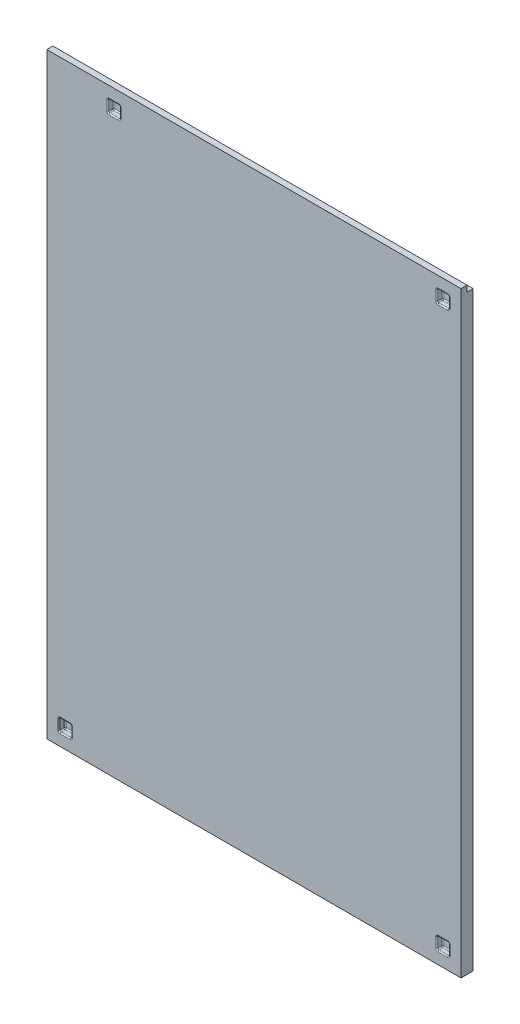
ISO-10303-21;
HEADER;
FILE_DESCRIPTION(('STEP AP214'),'2;1');
FILE_NAME('part.step','',(''),(''),'','','');
FILE_SCHEMA(('AUTOMOTIVE_DESIGN { 1 0 10303 214 1 1 1 1 }'));
ENDSEC;
DATA;
#1=APPLICATION_CONTEXT('core data for automotive mechanical design processes');
#2=APPLICATION_PROTOCOL_DEFINITION('international standard','automotive_design',2000,#1);
#3=PRODUCT_CONTEXT('',#1,'mechanical');
#4=PRODUCT('Part','Part','',(#3));
#5=PRODUCT_RELATED_PRODUCT_CATEGORY('part','',(#4));
#6=PRODUCT_DEFINITION_FORMATION('','',#4);
#7=PRODUCT_DEFINITION_CONTEXT('part definition',#1,'design');
#8=PRODUCT_DEFINITION('design','',#6,#7);
#9=PRODUCT_DEFINITION_SHAPE('','',#8);
#10=(LENGTH_UNIT() NAMED_UNIT(*) SI_UNIT(.MILLI.,.METRE.));
#11=(NAMED_UNIT(*) PLANE_ANGLE_UNIT() SI_UNIT($,.RADIAN.));
#12=(NAMED_UNIT(*) SI_UNIT($,.STERADIAN.) SOLID_ANGLE_UNIT());
#13=UNCERTAINTY_MEASURE_WITH_UNIT(LENGTH_MEASURE(1.E-05),#10,'distance_accuracy_value','');
#14=(GEOMETRIC_REPRESENTATION_CONTEXT(3) GLOBAL_UNCERTAINTY_ASSIGNED_CONTEXT((#13)) GLOBAL_UNIT_ASSIGNED_CONTEXT((#10,
#11,#12)) REPRESENTATION_CONTEXT('',''));
#15=CARTESIAN_POINT('',(0.,0.,0.));
#16=DIRECTION('',(0.,0.,1.));
#17=DIRECTION('',(1.,0.,0.));
#18=AXIS2_PLACEMENT_3D('',#15,#16,#17);
#19=CARTESIAN_POINT('',(0.,0.,2.));
#20=DIRECTION('',(0.,0.,-1.));
#21=DIRECTION('',(-1.,0.,0.));
#22=AXIS2_PLACEMENT_3D('',#19,#20,#21);
#23=PLANE('',#22);
#24=CARTESIAN_POINT('',(3.8,2.2,2.));
#25=DIRECTION('',(0.,0.,-1.));
#26=DIRECTION('',(-1.,0.,0.));
#27=AXIS2_PLACEMENT_3D('',#24,#25,#26);
#28=CIRCLE('',#27,0.4);
#29=CARTESIAN_POINT('',(3.8,1.8,2.));
#30=VERTEX_POINT('',#29);
#31=CARTESIAN_POINT('',(4.2,2.2,2.));
#32=VERTEX_POINT('',#31);
#33=EDGE_CURVE('E614',#30,#32,#28,.F.);
#34=ORIENTED_EDGE('',*,*,#33,.F.);
#35=DIRECTION('',(1.,0.,0.));
#36=VECTOR('',#35,1.);
#37=CARTESIAN_POINT('',(0.,1.8,2.));
#38=LINE('',#37,#36);
#39=CARTESIAN_POINT('',(2.2,1.8,2.));
#40=VERTEX_POINT('',#39);
#41=EDGE_CURVE('E639',#30,#40,#38,.F.);
#42=ORIENTED_EDGE('',*,*,#41,.T.);
#43=CARTESIAN_POINT('',(2.2,2.2,2.));
#44=DIRECTION('',(0.,0.,-1.));
#45=DIRECTION('',(-1.,0.,0.));
#46=AXIS2_PLACEMENT_3D('',#43,#44,#45);
#47=CIRCLE('',#46,0.4);
#48=CARTESIAN_POINT('',(1.8,2.2,2.));
#49=VERTEX_POINT('',#48);
#50=EDGE_CURVE('E635',#49,#40,#47,.F.);
#51=ORIENTED_EDGE('',*,*,#50,.F.);
#52=DIRECTION('',(0.,-1.,0.));
#53=VECTOR('',#52,1.);
#54=CARTESIAN_POINT('',(1.8,0.,2.));
#55=LINE('',#54,#53);
#56=CARTESIAN_POINT('',(1.8,3.8,2.));
#57=VERTEX_POINT('',#56);
#58=EDGE_CURVE('E632',#49,#57,#55,.F.);
#59=ORIENTED_EDGE('',*,*,#58,.T.);
#60=CARTESIAN_POINT('',(2.2,3.8,2.));
#61=DIRECTION('',(0.,0.,-1.));
#62=DIRECTION('',(-1.,0.,0.));
#63=AXIS2_PLACEMENT_3D('',#60,#61,#62);
#64=CIRCLE('',#63,0.4);
#65=CARTESIAN_POINT('',(2.2,4.2,2.));
#66=VERTEX_POINT('',#65);
#67=EDGE_CURVE('E628',#66,#57,#64,.F.);
#68=ORIENTED_EDGE('',*,*,#67,.F.);
#69=DIRECTION('',(-1.,0.,0.));
#70=VECTOR('',#69,1.);
#71=CARTESIAN_POINT('',(0.,4.2,2.));
#72=LINE('',#71,#70);
#73=CARTESIAN_POINT('',(3.8,4.2,2.));
#74=VERTEX_POINT('',#73);
#75=EDGE_CURVE('E625',#66,#74,#72,.F.);
#76=ORIENTED_EDGE('',*,*,#75,.T.);
#77=CARTESIAN_POINT('',(3.8,3.8,2.));
#78=DIRECTION('',(0.,0.,-1.));
#79=DIRECTION('',(-1.,0.,0.));
#80=AXIS2_PLACEMENT_3D('',#77,#78,#79);
#81=CIRCLE('',#80,0.4);
#82=CARTESIAN_POINT('',(4.2,3.8,2.));
#83=VERTEX_POINT('',#82);
#84=EDGE_CURVE('E621',#83,#74,#81,.F.);
#85=ORIENTED_EDGE('',*,*,#84,.F.);
#86=DIRECTION('',(0.,1.,0.));
#87=VECTOR('',#86,1.);
#88=CARTESIAN_POINT('',(4.2,0.,2.));
#89=LINE('',#88,#87);
#90=EDGE_CURVE('E618',#83,#32,#89,.F.);
#91=ORIENTED_EDGE('',*,*,#90,.T.);
#92=EDGE_LOOP('',(#34,#42,#51,#59,#68,#76,#85,#91));
#93=FACE_BOUND('',#92,.T.);
#94=CARTESIAN_POINT('',(65.8,2.2,2.));
#95=DIRECTION('',(0.,0.,-1.));
#96=DIRECTION('',(-1.,0.,0.));
#97=AXIS2_PLACEMENT_3D('',#94,#95,#96);
#98=CIRCLE('',#97,0.4);
#99=CARTESIAN_POINT('',(65.8,1.8,2.));
#100=VERTEX_POINT('',#99);
#101=CARTESIAN_POINT('',(66.2,2.2,2.));
#102=VERTEX_POINT('',#101);
#103=EDGE_CURVE('E586',#100,#102,#98,.F.);
#104=ORIENTED_EDGE('',*,*,#103,.F.);
#105=DIRECTION('',(1.,0.,0.));
#106=VECTOR('',#105,1.);
#107=CARTESIAN_POINT('',(0.,1.8,2.));
#108=LINE('',#107,#106);
#109=CARTESIAN_POINT('',(64.2,1.8,2.));
#110=VERTEX_POINT('',#109);
#111=EDGE_CURVE('E610',#100,#110,#108,.F.);
#112=ORIENTED_EDGE('',*,*,#111,.T.);
#113=CARTESIAN_POINT('',(64.2,2.2,2.));
#114=DIRECTION('',(0.,0.,-1.));
#115=DIRECTION('',(-1.,0.,0.));
#116=AXIS2_PLACEMENT_3D('',#113,#114,#115);
#117=CIRCLE('',#116,0.4);
#118=CARTESIAN_POINT('',(63.8,2.2,2.));
#119=VERTEX_POINT('',#118);
#120=EDGE_CURVE('E607',#119,#110,#117,.F.);
#121=ORIENTED_EDGE('',*,*,#120,.F.);
#122=DIRECTION('',(0.,-1.,0.));
#123=VECTOR('',#122,1.);
#124=CARTESIAN_POINT('',(63.8,0.,2.));
#125=LINE('',#124,#123);
#126=CARTESIAN_POINT('',(63.8,3.8,2.));
#127=VERTEX_POINT('',#126);
#128=EDGE_CURVE('E604',#119,#127,#125,.F.);
#129=ORIENTED_EDGE('',*,*,#128,.T.);
#130=CARTESIAN_POINT('',(64.2,3.8,2.));
#131=DIRECTION('',(0.,0.,-1.));
#132=DIRECTION('',(-1.,0.,0.));
#133=AXIS2_PLACEMENT_3D('',#130,#131,#132);
#134=CIRCLE('',#133,0.4);
#135=CARTESIAN_POINT('',(64.2,4.2,2.));
#136=VERTEX_POINT('',#135);
#137=EDGE_CURVE('E600',#136,#127,#134,.F.);
#138=ORIENTED_EDGE('',*,*,#137,.F.);
#139=DIRECTION('',(-1.,0.,0.));
#140=VECTOR('',#139,1.);
#141=CARTESIAN_POINT('',(0.,4.2,2.));
#142=LINE('',#141,#140);
#143=CARTESIAN_POINT('',(65.8,4.2,2.));
#144=VERTEX_POINT('',#143);
#145=EDGE_CURVE('E597',#136,#144,#142,.F.);
#146=ORIENTED_EDGE('',*,*,#145,.T.);
#147=CARTESIAN_POINT('',(65.8,3.8,2.));
#148=DIRECTION('',(0.,0.,-1.));
#149=DIRECTION('',(-1.,0.,0.));
#150=AXIS2_PLACEMENT_3D('',#147,#148,#149);
#151=CIRCLE('',#150,0.4);
#152=CARTESIAN_POINT('',(66.2,3.8,2.));
#153=VERTEX_POINT('',#152);
#154=EDGE_CURVE('E593',#153,#144,#151,.F.);
#155=ORIENTED_EDGE('',*,*,#154,.F.);
#156=DIRECTION('',(0.,1.,0.));
#157=VECTOR('',#156,1.);
#158=CARTESIAN_POINT('',(66.2,0.,2.));
#159=LINE('',#158,#157);
#160=EDGE_CURVE('E590',#153,#102,#159,.F.);
#161=ORIENTED_EDGE('',*,*,#160,.T.);
#162=EDGE_LOOP('',(#104,#112,#121,#129,#138,#146,#155,#161));
#163=FACE_BOUND('',#162,.T.);
#164=DIRECTION('',(0.,-1.,0.));
#165=VECTOR('',#164,1.);
#166=CARTESIAN_POINT('',(0.,0.,2.));
#167=LINE('',#166,#165);
#168=CARTESIAN_POINT('',(0.,98.,2.));
#169=VERTEX_POINT('',#168);
#170=CARTESIAN_POINT('',(0.,0.,2.));
#171=VERTEX_POINT('',#170);
#172=EDGE_CURVE('E2422',#169,#171,#167,.T.);
#173=ORIENTED_EDGE('',*,*,#172,.T.);
#174=DIRECTION('',(1.,0.,0.));
#175=VECTOR('',#174,1.);
#176=CARTESIAN_POINT('',(0.,0.,2.));
#177=LINE('',#176,#175);
#178=CARTESIAN_POINT('',(68.,0.,2.));
#179=VERTEX_POINT('',#178);
#180=EDGE_CURVE('E2424',#171,#179,#177,.T.);
#181=ORIENTED_EDGE('',*,*,#180,.T.);
#182=DIRECTION('',(0.,1.,0.));
#183=VECTOR('',#182,1.);
#184=CARTESIAN_POINT('',(68.,0.,2.));
#185=LINE('',#184,#183);
#186=CARTESIAN_POINT('',(68.,98.,2.));
#187=VERTEX_POINT('',#186);
#188=EDGE_CURVE('E2434',#179,#187,#185,.T.);
#189=ORIENTED_EDGE('',*,*,#188,.T.);
#190=DIRECTION('',(-1.,0.,0.));
#191=VECTOR('',#190,1.);
#192=CARTESIAN_POINT('',(0.,98.,2.));
#193=LINE('',#192,#191);
#194=EDGE_CURVE('E460',#187,#169,#193,.T.);
#195=ORIENTED_EDGE('',*,*,#194,.T.);
#196=EDGE_LOOP('',(#173,#181,#189,#195));
#197=FACE_BOUND('',#196,.T.);
#198=CARTESIAN_POINT('',(11.8,94.2,2.));
#199=DIRECTION('',(0.,0.,-1.));
#200=DIRECTION('',(-1.,0.,0.));
#201=AXIS2_PLACEMENT_3D('',#198,#199,#200);
#202=CIRCLE('',#201,0.4);
#203=CARTESIAN_POINT('',(11.8,93.8,2.));
#204=VERTEX_POINT('',#203);
#205=CARTESIAN_POINT('',(12.2,94.2,2.));
#206=VERTEX_POINT('',#205);
#207=EDGE_CURVE('E528',#204,#206,#202,.F.);
#208=ORIENTED_EDGE('',*,*,#207,.F.);
#209=DIRECTION('',(1.,0.,0.));
#210=VECTOR('',#209,1.);
#211=CARTESIAN_POINT('',(0.,93.8,2.));
#212=LINE('',#211,#210);
#213=CARTESIAN_POINT('',(10.2,93.8,2.));
#214=VERTEX_POINT('',#213);
#215=EDGE_CURVE('E553',#204,#214,#212,.F.);
#216=ORIENTED_EDGE('',*,*,#215,.T.);
#217=CARTESIAN_POINT('',(10.2,94.2,2.));
#218=DIRECTION('',(0.,0.,-1.));
#219=DIRECTION('',(-1.,0.,0.));
#220=AXIS2_PLACEMENT_3D('',#217,#218,#219);
#221=CIRCLE('',#220,0.4);
#222=CARTESIAN_POINT('',(9.79999999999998,94.2,2.));
#223=VERTEX_POINT('',#222);
#224=EDGE_CURVE('E549',#223,#214,#221,.F.);
#225=ORIENTED_EDGE('',*,*,#224,.F.);
#226=DIRECTION('',(0.,-1.,0.));
#227=VECTOR('',#226,1.);
#228=CARTESIAN_POINT('',(9.79999999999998,0.,2.));
#229=LINE('',#228,#227);
#230=CARTESIAN_POINT('',(9.79999999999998,95.8,2.));
#231=VERTEX_POINT('',#230);
#232=EDGE_CURVE('E546',#223,#231,#229,.F.);
#233=ORIENTED_EDGE('',*,*,#232,.T.);
#234=CARTESIAN_POINT('',(10.2,95.8,2.));
#235=DIRECTION('',(0.,0.,-1.));
#236=DIRECTION('',(-1.,0.,0.));
#237=AXIS2_PLACEMENT_3D('',#234,#235,#236);
#238=CIRCLE('',#237,0.4);
#239=CARTESIAN_POINT('',(10.2,96.2,2.));
#240=VERTEX_POINT('',#239);
#241=EDGE_CURVE('E542',#240,#231,#238,.F.);
#242=ORIENTED_EDGE('',*,*,#241,.F.);
#243=DIRECTION('',(-1.,0.,0.));
#244=VECTOR('',#243,1.);
#245=CARTESIAN_POINT('',(0.,96.2,2.));
#246=LINE('',#245,#244);
#247=CARTESIAN_POINT('',(11.8,96.2,2.));
#248=VERTEX_POINT('',#247);
#249=EDGE_CURVE('E539',#240,#248,#246,.F.);
#250=ORIENTED_EDGE('',*,*,#249,.T.);
#251=CARTESIAN_POINT('',(11.8,95.8,2.));
#252=DIRECTION('',(0.,0.,-1.));
#253=DIRECTION('',(-1.,0.,0.));
#254=AXIS2_PLACEMENT_3D('',#251,#252,#253);
#255=CIRCLE('',#254,0.4);
#256=CARTESIAN_POINT('',(12.2,95.8,2.));
#257=VERTEX_POINT('',#256);
#258=EDGE_CURVE('E535',#257,#248,#255,.F.);
#259=ORIENTED_EDGE('',*,*,#258,.F.);
#260=DIRECTION('',(0.,1.,0.));
#261=VECTOR('',#260,1.);
#262=CARTESIAN_POINT('',(12.2,0.,2.));
#263=LINE('',#262,#261);
#264=EDGE_CURVE('E532',#257,#206,#263,.F.);
#265=ORIENTED_EDGE('',*,*,#264,.T.);
#266=EDGE_LOOP('',(#208,#216,#225,#233,#242,#250,#259,#265));
#267=FACE_BOUND('',#266,.T.);
#268=CARTESIAN_POINT('',(64.2,94.2,2.));
#269=DIRECTION('',(0.,0.,-1.));
#270=DIRECTION('',(-1.,0.,0.));
#271=AXIS2_PLACEMENT_3D('',#268,#269,#270);
#272=CIRCLE('',#271,0.4);
#273=CARTESIAN_POINT('',(63.8,94.2,2.));
#274=VERTEX_POINT('',#273);
#275=CARTESIAN_POINT('',(64.2,93.8,2.));
#276=VERTEX_POINT('',#275);
#277=EDGE_CURVE('E582',#274,#276,#272,.F.);
#278=ORIENTED_EDGE('',*,*,#277,.F.);
#279=DIRECTION('',(0.,-1.,0.));
#280=VECTOR('',#279,1.);
#281=CARTESIAN_POINT('',(63.8,0.,2.));
#282=LINE('',#281,#280);
#283=CARTESIAN_POINT('',(63.8,95.8,2.));
#284=VERTEX_POINT('',#283);
#285=EDGE_CURVE('E578',#274,#284,#282,.F.);
#286=ORIENTED_EDGE('',*,*,#285,.T.);
#287=CARTESIAN_POINT('',(64.2,95.8,2.));
#288=DIRECTION('',(0.,0.,-1.));
#289=DIRECTION('',(-1.,0.,0.));
#290=AXIS2_PLACEMENT_3D('',#287,#288,#289);
#291=CIRCLE('',#290,0.4);
#292=CARTESIAN_POINT('',(64.2,96.2,2.));
#293=VERTEX_POINT('',#292);
#294=EDGE_CURVE('E574',#293,#284,#291,.F.);
#295=ORIENTED_EDGE('',*,*,#294,.F.);
#296=DIRECTION('',(-1.,0.,0.));
#297=VECTOR('',#296,1.);
#298=CARTESIAN_POINT('',(0.,96.2,2.));
#299=LINE('',#298,#297);
#300=CARTESIAN_POINT('',(65.8,96.2,2.));
#301=VERTEX_POINT('',#300);
#302=EDGE_CURVE('E571',#293,#301,#299,.F.);
#303=ORIENTED_EDGE('',*,*,#302,.T.);
#304=CARTESIAN_POINT('',(65.8,95.8,2.));
#305=DIRECTION('',(0.,0.,-1.));
#306=DIRECTION('',(-1.,0.,0.));
#307=AXIS2_PLACEMENT_3D('',#304,#305,#306);
#308=CIRCLE('',#307,0.4);
#309=CARTESIAN_POINT('',(66.2,95.8,2.));
#310=VERTEX_POINT('',#309);
#311=EDGE_CURVE('E567',#310,#301,#308,.F.);
#312=ORIENTED_EDGE('',*,*,#311,.F.);
#313=DIRECTION('',(0.,1.,0.));
#314=VECTOR('',#313,1.);
#315=CARTESIAN_POINT('',(66.2,0.,2.));
#316=LINE('',#315,#314);
#317=CARTESIAN_POINT('',(66.2,94.2,2.));
#318=VERTEX_POINT('',#317);
#319=EDGE_CURVE('E561',#310,#318,#316,.F.);
#320=ORIENTED_EDGE('',*,*,#319,.T.);
#321=CARTESIAN_POINT('',(65.8,94.2,2.));
#322=DIRECTION('',(0.,0.,-1.));
#323=DIRECTION('',(-1.,0.,0.));
#324=AXIS2_PLACEMENT_3D('',#321,#322,#323);
#325=CIRCLE('',#324,0.4);
#326=CARTESIAN_POINT('',(65.8,93.8,2.));
#327=VERTEX_POINT('',#326);
#328=EDGE_CURVE('E557',#327,#318,#325,.F.);
#329=ORIENTED_EDGE('',*,*,#328,.F.);
#330=DIRECTION('',(1.,0.,0.));
#331=VECTOR('',#330,1.);
#332=CARTESIAN_POINT('',(0.,93.8,2.));
#333=LINE('',#332,#331);
#334=EDGE_CURVE('E564',#327,#276,#333,.F.);
#335=ORIENTED_EDGE('',*,*,#334,.T.);
#336=EDGE_LOOP('',(#278,#286,#295,#303,#312,#320,#329,#335));
#337=FACE_BOUND('',#336,.T.);
#338=ADVANCED_FACE('F45',(#93,#163,#197,#267,#337),#23,.F.);
#339=CARTESIAN_POINT('',(0.,0.,2.));
#340=DIRECTION('',(1.,0.,0.));
#341=DIRECTION('',(0.,0.,-1.));
#342=AXIS2_PLACEMENT_3D('',#339,#340,#341);
#343=PLANE('',#342);
#344=DIRECTION('',(0.,0.,-1.));
#345=VECTOR('',#344,1.);
#346=CARTESIAN_POINT('',(0.,98.,2.));
#347=LINE('',#346,#345);
#348=CARTESIAN_POINT('',(0.,98.,1.));
#349=VERTEX_POINT('',#348);
#350=EDGE_CURVE('E463',#169,#349,#347,.T.);
#351=ORIENTED_EDGE('',*,*,#350,.T.);
#352=DIRECTION('',(0.,1.,0.));
#353=VECTOR('',#352,1.);
#354=CARTESIAN_POINT('',(0.,97.,1.));
#355=LINE('',#354,#353);
#356=CARTESIAN_POINT('',(0.,97.,1.));
#357=VERTEX_POINT('',#356);
#358=EDGE_CURVE('E441',#357,#349,#355,.T.);
#359=ORIENTED_EDGE('',*,*,#358,.F.);
#360=DIRECTION('',(0.,0.,1.));
#361=VECTOR('',#360,1.);
#362=CARTESIAN_POINT('',(0.,97.,1.));
#363=LINE('',#362,#361);
#364=CARTESIAN_POINT('',(0.,97.,0.));
#365=VERTEX_POINT('',#364);
#366=EDGE_CURVE('E457',#365,#357,#363,.T.);
#367=ORIENTED_EDGE('',*,*,#366,.F.);
#368=DIRECTION('',(0.,-1.,0.));
#369=VECTOR('',#368,1.);
#370=CARTESIAN_POINT('',(0.,0.,0.));
#371=LINE('',#370,#369);
#372=CARTESIAN_POINT('',(0.,0.,0.));
#373=VERTEX_POINT('',#372);
#374=EDGE_CURVE('E938',#365,#373,#371,.T.);
#375=ORIENTED_EDGE('',*,*,#374,.T.);
#376=DIRECTION('',(0.,0.,-1.));
#377=VECTOR('',#376,1.);
#378=CARTESIAN_POINT('',(0.,0.,2.));
#379=LINE('',#378,#377);
#380=EDGE_CURVE('E468',#171,#373,#379,.T.);
#381=ORIENTED_EDGE('',*,*,#380,.F.);
#382=ORIENTED_EDGE('',*,*,#172,.F.);
#383=EDGE_LOOP('',(#351,#359,#367,#375,#381,#382));
#384=FACE_BOUND('',#383,.T.);
#385=ADVANCED_FACE('F1297',(#384),#343,.F.);
#386=CARTESIAN_POINT('',(0.,0.,2.));
#387=DIRECTION('',(0.,1.,0.));
#388=DIRECTION('',(0.,0.,1.));
#389=AXIS2_PLACEMENT_3D('',#386,#387,#388);
#390=PLANE('',#389);
#391=DIRECTION('',(1.,0.,0.));
#392=VECTOR('',#391,1.);
#393=CARTESIAN_POINT('',(0.,0.,0.));
#394=LINE('',#393,#392);
#395=CARTESIAN_POINT('',(68.,0.,0.));
#396=VERTEX_POINT('',#395);
#397=EDGE_CURVE('E2432',#373,#396,#394,.T.);
#398=ORIENTED_EDGE('',*,*,#397,.T.);
#399=DIRECTION('',(0.,0.,-1.));
#400=VECTOR('',#399,1.);
#401=CARTESIAN_POINT('',(68.,0.,2.));
#402=LINE('',#401,#400);
#403=EDGE_CURVE('E462',#179,#396,#402,.T.);
#404=ORIENTED_EDGE('',*,*,#403,.F.);
#405=ORIENTED_EDGE('',*,*,#180,.F.);
#406=ORIENTED_EDGE('',*,*,#380,.T.);
#407=EDGE_LOOP('',(#398,#404,#405,#406));
#408=FACE_BOUND('',#407,.T.);
#409=ADVANCED_FACE('F1305',(#408),#390,.F.);
#410=CARTESIAN_POINT('',(68.,0.,2.));
#411=DIRECTION('',(-1.,0.,0.));
#412=DIRECTION('',(0.,0.,1.));
#413=AXIS2_PLACEMENT_3D('',#410,#411,#412);
#414=PLANE('',#413);
#415=DIRECTION('',(0.,0.,1.));
#416=VECTOR('',#415,1.);
#417=CARTESIAN_POINT('',(68.,97.,1.));
#418=LINE('',#417,#416);
#419=CARTESIAN_POINT('',(68.,97.,0.));
#420=VERTEX_POINT('',#419);
#421=CARTESIAN_POINT('',(68.,97.,1.));
#422=VERTEX_POINT('',#421);
#423=EDGE_CURVE('E63',#420,#422,#418,.T.);
#424=ORIENTED_EDGE('',*,*,#423,.T.);
#425=DIRECTION('',(0.,1.,0.));
#426=VECTOR('',#425,1.);
#427=CARTESIAN_POINT('',(68.,97.,1.));
#428=LINE('',#427,#426);
#429=CARTESIAN_POINT('',(68.,98.,1.));
#430=VERTEX_POINT('',#429);
#431=EDGE_CURVE('E439',#422,#430,#428,.T.);
#432=ORIENTED_EDGE('',*,*,#431,.T.);
#433=DIRECTION('',(0.,0.,-1.));
#434=VECTOR('',#433,1.);
#435=CARTESIAN_POINT('',(68.,98.,2.));
#436=LINE('',#435,#434);
#437=EDGE_CURVE('E453',#187,#430,#436,.T.);
#438=ORIENTED_EDGE('',*,*,#437,.F.);
#439=ORIENTED_EDGE('',*,*,#188,.F.);
#440=ORIENTED_EDGE('',*,*,#403,.T.);
#441=DIRECTION('',(0.,1.,0.));
#442=VECTOR('',#441,1.);
#443=CARTESIAN_POINT('',(68.,0.,0.));
#444=LINE('',#443,#442);
#445=EDGE_CURVE('E2427',#396,#420,#444,.T.);
#446=ORIENTED_EDGE('',*,*,#445,.T.);
#447=EDGE_LOOP('',(#424,#432,#438,#439,#440,#446));
#448=FACE_BOUND('',#447,.T.);
#449=ADVANCED_FACE('F451',(#448),#414,.F.);
#450=CARTESIAN_POINT('',(0.,98.,2.));
#451=DIRECTION('',(0.,-1.,0.));
#452=DIRECTION('',(0.,0.,-1.));
#453=AXIS2_PLACEMENT_3D('',#450,#451,#452);
#454=PLANE('',#453);
#455=ORIENTED_EDGE('',*,*,#437,.T.);
#456=DIRECTION('',(-1.,0.,0.));
#457=VECTOR('',#456,1.);
#458=CARTESIAN_POINT('',(68.,98.,1.));
#459=LINE('',#458,#457);
#460=EDGE_CURVE('E436',#430,#349,#459,.T.);
#461=ORIENTED_EDGE('',*,*,#460,.T.);
#462=ORIENTED_EDGE('',*,*,#350,.F.);
#463=ORIENTED_EDGE('',*,*,#194,.F.);
#464=EDGE_LOOP('',(#455,#461,#462,#463));
#465=FACE_BOUND('',#464,.T.);
#466=ADVANCED_FACE('F459',(#465),#454,.F.);
#467=CARTESIAN_POINT('',(0.,0.,0.));
#468=DIRECTION('',(0.,0.,-1.));
#469=DIRECTION('',(-1.,0.,0.));
#470=AXIS2_PLACEMENT_3D('',#467,#468,#469);
#471=PLANE('',#470);
#472=DIRECTION('',(-1.,0.,0.));
#473=VECTOR('',#472,1.);
#474=CARTESIAN_POINT('',(68.,97.,0.));
#475=LINE('',#474,#473);
#476=EDGE_CURVE('E447',#420,#365,#475,.T.);
#477=ORIENTED_EDGE('',*,*,#476,.F.);
#478=ORIENTED_EDGE('',*,*,#445,.F.);
#479=ORIENTED_EDGE('',*,*,#397,.F.);
#480=ORIENTED_EDGE('',*,*,#374,.F.);
#481=EDGE_LOOP('',(#477,#478,#479,#480));
#482=FACE_BOUND('',#481,.T.);
#483=ADVANCED_FACE('F1313',(#482),#471,.T.);
#484=CARTESIAN_POINT('',(64.,96.,1.));
#485=DIRECTION('',(-1.,0.,0.));
#486=DIRECTION('',(0.,0.,1.));
#487=AXIS2_PLACEMENT_3D('',#484,#485,#486);
#488=PLANE('',#487);
#489=DIRECTION('',(0.,-1.,0.));
#490=VECTOR('',#489,1.);
#491=CARTESIAN_POINT('',(64.,96.,1.8));
#492=LINE('',#491,#490);
#493=CARTESIAN_POINT('',(64.,95.8,1.8));
#494=VERTEX_POINT('',#493);
#495=CARTESIAN_POINT('',(64.,94.2,1.8));
#496=VERTEX_POINT('',#495);
#497=EDGE_CURVE('E750',#494,#496,#492,.T.);
#498=ORIENTED_EDGE('',*,*,#497,.T.);
#499=DIRECTION('',(0.,0.,1.));
#500=VECTOR('',#499,1.);
#501=CARTESIAN_POINT('',(64.,94.2,1.));
#502=LINE('',#501,#500);
#503=CARTESIAN_POINT('',(64.,94.2,1.2));
#504=VERTEX_POINT('',#503);
#505=EDGE_CURVE('E756',#496,#504,#502,.F.);
#506=ORIENTED_EDGE('',*,*,#505,.T.);
#507=DIRECTION('',(0.,-1.,0.));
#508=VECTOR('',#507,1.);
#509=CARTESIAN_POINT('',(64.,96.,1.2));
#510=LINE('',#509,#508);
#511=CARTESIAN_POINT('',(64.,95.8,1.2));
#512=VERTEX_POINT('',#511);
#513=EDGE_CURVE('E753',#504,#512,#510,.F.);
#514=ORIENTED_EDGE('',*,*,#513,.T.);
#515=DIRECTION('',(0.,0.,1.));
#516=VECTOR('',#515,1.);
#517=CARTESIAN_POINT('',(64.,95.8,2.));
#518=LINE('',#517,#516);
#519=EDGE_CURVE('E747',#512,#494,#518,.T.);
#520=ORIENTED_EDGE('',*,*,#519,.T.);
#521=EDGE_LOOP('',(#498,#506,#514,#520));
#522=FACE_BOUND('',#521,.T.);
#523=ADVANCED_FACE('F1311',(#522),#488,.F.);
#524=CARTESIAN_POINT('',(64.,96.,1.));
#525=DIRECTION('',(0.,1.,0.));
#526=DIRECTION('',(0.,0.,1.));
#527=AXIS2_PLACEMENT_3D('',#524,#525,#526);
#528=PLANE('',#527);
#529=DIRECTION('',(-1.,0.,0.));
#530=VECTOR('',#529,1.);
#531=CARTESIAN_POINT('',(64.,96.,1.8));
#532=LINE('',#531,#530);
#533=CARTESIAN_POINT('',(65.8,96.,1.8));
#534=VERTEX_POINT('',#533);
#535=CARTESIAN_POINT('',(64.2,96.,1.8));
#536=VERTEX_POINT('',#535);
#537=EDGE_CURVE('E763',#534,#536,#532,.T.);
#538=ORIENTED_EDGE('',*,*,#537,.T.);
#539=DIRECTION('',(0.,0.,1.));
#540=VECTOR('',#539,1.);
#541=CARTESIAN_POINT('',(64.2,96.,1.));
#542=LINE('',#541,#540);
#543=CARTESIAN_POINT('',(64.2,96.,1.2));
#544=VERTEX_POINT('',#543);
#545=EDGE_CURVE('E769',#536,#544,#542,.F.);
#546=ORIENTED_EDGE('',*,*,#545,.T.);
#547=DIRECTION('',(-1.,0.,0.));
#548=VECTOR('',#547,1.);
#549=CARTESIAN_POINT('',(64.,96.,1.2));
#550=LINE('',#549,#548);
#551=CARTESIAN_POINT('',(65.8,96.,1.2));
#552=VERTEX_POINT('',#551);
#553=EDGE_CURVE('E766',#544,#552,#550,.F.);
#554=ORIENTED_EDGE('',*,*,#553,.T.);
#555=DIRECTION('',(0.,0.,1.));
#556=VECTOR('',#555,1.);
#557=CARTESIAN_POINT('',(65.8,96.,2.));
#558=LINE('',#557,#556);
#559=EDGE_CURVE('E760',#552,#534,#558,.T.);
#560=ORIENTED_EDGE('',*,*,#559,.T.);
#561=EDGE_LOOP('',(#538,#546,#554,#560));
#562=FACE_BOUND('',#561,.T.);
#563=ADVANCED_FACE('F2202',(#562),#528,.F.);
#564=CARTESIAN_POINT('',(66.,96.,1.));
#565=DIRECTION('',(1.,0.,0.));
#566=DIRECTION('',(0.,0.,-1.));
#567=AXIS2_PLACEMENT_3D('',#564,#565,#566);
#568=PLANE('',#567);
#569=DIRECTION('',(0.,1.,0.));
#570=VECTOR('',#569,1.);
#571=CARTESIAN_POINT('',(66.,96.,1.8));
#572=LINE('',#571,#570);
#573=CARTESIAN_POINT('',(66.,94.2,1.8));
#574=VERTEX_POINT('',#573);
#575=CARTESIAN_POINT('',(66.,95.8,1.8));
#576=VERTEX_POINT('',#575);
#577=EDGE_CURVE('E773',#574,#576,#572,.T.);
#578=ORIENTED_EDGE('',*,*,#577,.T.);
#579=DIRECTION('',(0.,0.,1.));
#580=VECTOR('',#579,1.);
#581=CARTESIAN_POINT('',(66.,95.8,1.));
#582=LINE('',#581,#580);
#583=CARTESIAN_POINT('',(66.,95.8,1.2));
#584=VERTEX_POINT('',#583);
#585=EDGE_CURVE('E782',#576,#584,#582,.F.);
#586=ORIENTED_EDGE('',*,*,#585,.T.);
#587=DIRECTION('',(0.,1.,0.));
#588=VECTOR('',#587,1.);
#589=CARTESIAN_POINT('',(66.,96.,1.2));
#590=LINE('',#589,#588);
#591=CARTESIAN_POINT('',(66.,94.2,1.2));
#592=VERTEX_POINT('',#591);
#593=EDGE_CURVE('E779',#584,#592,#590,.F.);
#594=ORIENTED_EDGE('',*,*,#593,.T.);
#595=DIRECTION('',(0.,0.,1.));
#596=VECTOR('',#595,1.);
#597=CARTESIAN_POINT('',(66.,94.2,2.));
#598=LINE('',#597,#596);
#599=EDGE_CURVE('E776',#592,#574,#598,.T.);
#600=ORIENTED_EDGE('',*,*,#599,.T.);
#601=EDGE_LOOP('',(#578,#586,#594,#600));
#602=FACE_BOUND('',#601,.T.);
#603=ADVANCED_FACE('F2194',(#602),#568,.F.);
#604=CARTESIAN_POINT('',(64.,94.,1.));
#605=DIRECTION('',(0.,-1.,0.));
#606=DIRECTION('',(0.,0.,-1.));
#607=AXIS2_PLACEMENT_3D('',#604,#605,#606);
#608=PLANE('',#607);
#609=DIRECTION('',(0.,0.,1.));
#610=VECTOR('',#609,1.);
#611=CARTESIAN_POINT('',(65.8,94.,1.));
#612=LINE('',#611,#610);
#613=CARTESIAN_POINT('',(65.8,94.,1.8));
#614=VERTEX_POINT('',#613);
#615=CARTESIAN_POINT('',(65.8,94.,1.2));
#616=VERTEX_POINT('',#615);
#617=EDGE_CURVE('E737',#614,#616,#612,.F.);
#618=ORIENTED_EDGE('',*,*,#617,.T.);
#619=DIRECTION('',(1.,0.,0.));
#620=VECTOR('',#619,1.);
#621=CARTESIAN_POINT('',(64.,94.,1.2));
#622=LINE('',#621,#620);
#623=CARTESIAN_POINT('',(64.2,94.,1.2));
#624=VERTEX_POINT('',#623);
#625=EDGE_CURVE('E743',#616,#624,#622,.F.);
#626=ORIENTED_EDGE('',*,*,#625,.T.);
#627=DIRECTION('',(0.,0.,1.));
#628=VECTOR('',#627,1.);
#629=CARTESIAN_POINT('',(64.2,94.,2.));
#630=LINE('',#629,#628);
#631=CARTESIAN_POINT('',(64.2,94.,1.8));
#632=VERTEX_POINT('',#631);
#633=EDGE_CURVE('E740',#624,#632,#630,.T.);
#634=ORIENTED_EDGE('',*,*,#633,.T.);
#635=DIRECTION('',(1.,0.,0.));
#636=VECTOR('',#635,1.);
#637=CARTESIAN_POINT('',(64.,94.,1.8));
#638=LINE('',#637,#636);
#639=EDGE_CURVE('E734',#632,#614,#638,.T.);
#640=ORIENTED_EDGE('',*,*,#639,.T.);
#641=EDGE_LOOP('',(#618,#626,#634,#640));
#642=FACE_BOUND('',#641,.T.);
#643=ADVANCED_FACE('F2185',(#642),#608,.F.);
#644=CARTESIAN_POINT('',(0.,0.,1.));
#645=DIRECTION('',(0.,0.,1.));
#646=DIRECTION('',(1.,0.,0.));
#647=AXIS2_PLACEMENT_3D('',#644,#645,#646);
#648=PLANE('',#647);
#649=DIRECTION('',(0.,-1.,0.));
#650=VECTOR('',#649,1.);
#651=CARTESIAN_POINT('',(64.2,0.,1.));
#652=LINE('',#651,#650);
#653=CARTESIAN_POINT('',(64.2,95.8,1.));
#654=VERTEX_POINT('',#653);
#655=CARTESIAN_POINT('',(64.2,94.2,1.));
#656=VERTEX_POINT('',#655);
#657=EDGE_CURVE('E727',#654,#656,#652,.T.);
#658=ORIENTED_EDGE('',*,*,#657,.T.);
#659=DIRECTION('',(1.,0.,0.));
#660=VECTOR('',#659,1.);
#661=CARTESIAN_POINT('',(0.,94.2,1.));
#662=LINE('',#661,#660);
#663=CARTESIAN_POINT('',(65.8,94.2,1.));
#664=VERTEX_POINT('',#663);
#665=EDGE_CURVE('E730',#656,#664,#662,.T.);
#666=ORIENTED_EDGE('',*,*,#665,.T.);
#667=DIRECTION('',(0.,1.,0.));
#668=VECTOR('',#667,1.);
#669=CARTESIAN_POINT('',(65.8,0.,1.));
#670=LINE('',#669,#668);
#671=CARTESIAN_POINT('',(65.8,95.8,1.));
#672=VERTEX_POINT('',#671);
#673=EDGE_CURVE('E721',#664,#672,#670,.T.);
#674=ORIENTED_EDGE('',*,*,#673,.T.);
#675=DIRECTION('',(-1.,0.,0.));
#676=VECTOR('',#675,1.);
#677=CARTESIAN_POINT('',(0.,95.8,1.));
#678=LINE('',#677,#676);
#679=EDGE_CURVE('E724',#672,#654,#678,.T.);
#680=ORIENTED_EDGE('',*,*,#679,.T.);
#681=EDGE_LOOP('',(#658,#666,#674,#680));
#682=FACE_BOUND('',#681,.T.);
#683=ADVANCED_FACE('F2177',(#682),#648,.T.);
#684=CARTESIAN_POINT('',(12.,96.,1.));
#685=DIRECTION('',(1.,0.,0.));
#686=DIRECTION('',(0.,0.,-1.));
#687=AXIS2_PLACEMENT_3D('',#684,#685,#686);
#688=PLANE('',#687);
#689=DIRECTION('',(0.,0.,1.));
#690=VECTOR('',#689,1.);
#691=CARTESIAN_POINT('',(12.,95.8,1.));
#692=LINE('',#691,#690);
#693=CARTESIAN_POINT('',(12.,95.8,1.8));
#694=VERTEX_POINT('',#693);
#695=CARTESIAN_POINT('',(12.,95.8,1.2));
#696=VERTEX_POINT('',#695);
#697=EDGE_CURVE('E805',#694,#696,#692,.F.);
#698=ORIENTED_EDGE('',*,*,#697,.T.);
#699=DIRECTION('',(0.,1.,0.));
#700=VECTOR('',#699,1.);
#701=CARTESIAN_POINT('',(12.,94.,1.2));
#702=LINE('',#701,#700);
#703=CARTESIAN_POINT('',(12.,94.2,1.2));
#704=VERTEX_POINT('',#703);
#705=EDGE_CURVE('E809',#696,#704,#702,.F.);
#706=ORIENTED_EDGE('',*,*,#705,.T.);
#707=DIRECTION('',(0.,0.,1.));
#708=VECTOR('',#707,1.);
#709=CARTESIAN_POINT('',(12.,94.2,2.));
#710=LINE('',#709,#708);
#711=CARTESIAN_POINT('',(12.,94.2,1.8));
#712=VERTEX_POINT('',#711);
#713=EDGE_CURVE('E802',#704,#712,#710,.T.);
#714=ORIENTED_EDGE('',*,*,#713,.T.);
#715=DIRECTION('',(0.,1.,0.));
#716=VECTOR('',#715,1.);
#717=CARTESIAN_POINT('',(12.,96.,1.8));
#718=LINE('',#717,#716);
#719=EDGE_CURVE('E799',#712,#694,#718,.T.);
#720=ORIENTED_EDGE('',*,*,#719,.T.);
#721=EDGE_LOOP('',(#698,#706,#714,#720));
#722=FACE_BOUND('',#721,.T.);
#723=ADVANCED_FACE('F1270',(#722),#688,.F.);
#724=CARTESIAN_POINT('',(12.,94.,1.));
#725=DIRECTION('',(0.,-1.,0.));
#726=DIRECTION('',(0.,0.,-1.));
#727=AXIS2_PLACEMENT_3D('',#724,#725,#726);
#728=PLANE('',#727);
#729=DIRECTION('',(1.,0.,0.));
#730=VECTOR('',#729,1.);
#731=CARTESIAN_POINT('',(9.99999999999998,94.,1.2));
#732=LINE('',#731,#730);
#733=CARTESIAN_POINT('',(11.8,94.,1.2));
#734=VERTEX_POINT('',#733);
#735=CARTESIAN_POINT('',(10.2,94.,1.2));
#736=VERTEX_POINT('',#735);
#737=EDGE_CURVE('E55',#734,#736,#732,.F.);
#738=ORIENTED_EDGE('',*,*,#737,.T.);
#739=DIRECTION('',(0.,0.,1.));
#740=VECTOR('',#739,1.);
#741=CARTESIAN_POINT('',(10.2,94.,2.));
#742=LINE('',#741,#740);
#743=CARTESIAN_POINT('',(10.2,94.,1.8));
#744=VERTEX_POINT('',#743);
#745=EDGE_CURVE('E11',#736,#744,#742,.T.);
#746=ORIENTED_EDGE('',*,*,#745,.T.);
#747=DIRECTION('',(1.,0.,0.));
#748=VECTOR('',#747,1.);
#749=CARTESIAN_POINT('',(12.,94.,1.8));
#750=LINE('',#749,#748);
#751=CARTESIAN_POINT('',(11.8,94.,1.8));
#752=VERTEX_POINT('',#751);
#753=EDGE_CURVE('E841',#744,#752,#750,.T.);
#754=ORIENTED_EDGE('',*,*,#753,.T.);
#755=DIRECTION('',(0.,0.,1.));
#756=VECTOR('',#755,1.);
#757=CARTESIAN_POINT('',(11.8,94.,1.));
#758=LINE('',#757,#756);
#759=EDGE_CURVE('E838',#752,#734,#758,.F.);
#760=ORIENTED_EDGE('',*,*,#759,.T.);
#761=EDGE_LOOP('',(#738,#746,#754,#760));
#762=FACE_BOUND('',#761,.T.);
#763=ADVANCED_FACE('F1250',(#762),#728,.F.);
#764=CARTESIAN_POINT('',(9.99999999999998,96.,1.));
#765=DIRECTION('',(-1.,0.,0.));
#766=DIRECTION('',(0.,0.,1.));
#767=AXIS2_PLACEMENT_3D('',#764,#765,#766);
#768=PLANE('',#767);
#769=DIRECTION('',(0.,-1.,0.));
#770=VECTOR('',#769,1.);
#771=CARTESIAN_POINT('',(9.99999999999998,96.,1.2));
#772=LINE('',#771,#770);
#773=CARTESIAN_POINT('',(9.99999999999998,94.2,1.2));
#774=VERTEX_POINT('',#773);
#775=CARTESIAN_POINT('',(9.99999999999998,95.8,1.2));
#776=VERTEX_POINT('',#775);
#777=EDGE_CURVE('E831',#774,#776,#772,.F.);
#778=ORIENTED_EDGE('',*,*,#777,.T.);
#779=DIRECTION('',(0.,0.,1.));
#780=VECTOR('',#779,1.);
#781=CARTESIAN_POINT('',(9.99999999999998,95.8,2.));
#782=LINE('',#781,#780);
#783=CARTESIAN_POINT('',(9.99999999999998,95.8,1.8));
#784=VERTEX_POINT('',#783);
#785=EDGE_CURVE('E834',#776,#784,#782,.T.);
#786=ORIENTED_EDGE('',*,*,#785,.T.);
#787=DIRECTION('',(0.,-1.,0.));
#788=VECTOR('',#787,1.);
#789=CARTESIAN_POINT('',(9.99999999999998,96.,1.8));
#790=LINE('',#789,#788);
#791=CARTESIAN_POINT('',(9.99999999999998,94.2,1.8));
#792=VERTEX_POINT('',#791);
#793=EDGE_CURVE('E825',#784,#792,#790,.T.);
#794=ORIENTED_EDGE('',*,*,#793,.T.);
#795=DIRECTION('',(0.,0.,1.));
#796=VECTOR('',#795,1.);
#797=CARTESIAN_POINT('',(9.99999999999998,94.2,1.));
#798=LINE('',#797,#796);
#799=EDGE_CURVE('E828',#792,#774,#798,.F.);
#800=ORIENTED_EDGE('',*,*,#799,.T.);
#801=EDGE_LOOP('',(#778,#786,#794,#800));
#802=FACE_BOUND('',#801,.T.);
#803=ADVANCED_FACE('F1236',(#802),#768,.F.);
#804=CARTESIAN_POINT('',(12.,96.,1.));
#805=DIRECTION('',(0.,1.,0.));
#806=DIRECTION('',(0.,0.,1.));
#807=AXIS2_PLACEMENT_3D('',#804,#805,#806);
#808=PLANE('',#807);
#809=DIRECTION('',(-1.,0.,0.));
#810=VECTOR('',#809,1.);
#811=CARTESIAN_POINT('',(12.,96.,1.2));
#812=LINE('',#811,#810);
#813=CARTESIAN_POINT('',(10.2,96.,1.2));
#814=VERTEX_POINT('',#813);
#815=CARTESIAN_POINT('',(11.8,96.,1.2));
#816=VERTEX_POINT('',#815);
#817=EDGE_CURVE('E792',#814,#816,#812,.F.);
#818=ORIENTED_EDGE('',*,*,#817,.T.);
#819=DIRECTION('',(0.,0.,1.));
#820=VECTOR('',#819,1.);
#821=CARTESIAN_POINT('',(11.8,96.,2.));
#822=LINE('',#821,#820);
#823=CARTESIAN_POINT('',(11.8,96.,1.8));
#824=VERTEX_POINT('',#823);
#825=EDGE_CURVE('E795',#816,#824,#822,.T.);
#826=ORIENTED_EDGE('',*,*,#825,.T.);
#827=DIRECTION('',(-1.,0.,0.));
#828=VECTOR('',#827,1.);
#829=CARTESIAN_POINT('',(12.,96.,1.8));
#830=LINE('',#829,#828);
#831=CARTESIAN_POINT('',(10.2,96.,1.8));
#832=VERTEX_POINT('',#831);
#833=EDGE_CURVE('E786',#824,#832,#830,.T.);
#834=ORIENTED_EDGE('',*,*,#833,.T.);
#835=DIRECTION('',(0.,0.,1.));
#836=VECTOR('',#835,1.);
#837=CARTESIAN_POINT('',(10.2,96.,1.));
#838=LINE('',#837,#836);
#839=EDGE_CURVE('E789',#832,#814,#838,.F.);
#840=ORIENTED_EDGE('',*,*,#839,.T.);
#841=EDGE_LOOP('',(#818,#826,#834,#840));
#842=FACE_BOUND('',#841,.T.);
#843=ADVANCED_FACE('F2147',(#842),#808,.F.);
#844=CARTESIAN_POINT('',(0.,0.,1.));
#845=DIRECTION('',(0.,0.,-1.));
#846=DIRECTION('',(-1.,0.,0.));
#847=AXIS2_PLACEMENT_3D('',#844,#845,#846);
#848=PLANE('',#847);
#849=DIRECTION('',(0.,1.,0.));
#850=VECTOR('',#849,1.);
#851=CARTESIAN_POINT('',(11.8,96.,1.));
#852=LINE('',#851,#850);
#853=CARTESIAN_POINT('',(11.8,94.2,1.));
#854=VERTEX_POINT('',#853);
#855=CARTESIAN_POINT('',(11.8,95.8,1.));
#856=VERTEX_POINT('',#855);
#857=EDGE_CURVE('E812',#854,#856,#852,.T.);
#858=ORIENTED_EDGE('',*,*,#857,.T.);
#859=DIRECTION('',(-1.,0.,0.));
#860=VECTOR('',#859,1.);
#861=CARTESIAN_POINT('',(9.99999999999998,95.8,1.));
#862=LINE('',#861,#860);
#863=CARTESIAN_POINT('',(10.2,95.8,1.));
#864=VERTEX_POINT('',#863);
#865=EDGE_CURVE('E821',#856,#864,#862,.T.);
#866=ORIENTED_EDGE('',*,*,#865,.T.);
#867=DIRECTION('',(0.,-1.,0.));
#868=VECTOR('',#867,1.);
#869=CARTESIAN_POINT('',(10.2,94.,1.));
#870=LINE('',#869,#868);
#871=CARTESIAN_POINT('',(10.2,94.2,1.));
#872=VERTEX_POINT('',#871);
#873=EDGE_CURVE('E818',#864,#872,#870,.T.);
#874=ORIENTED_EDGE('',*,*,#873,.T.);
#875=DIRECTION('',(1.,0.,0.));
#876=VECTOR('',#875,1.);
#877=CARTESIAN_POINT('',(12.,94.2,1.));
#878=LINE('',#877,#876);
#879=EDGE_CURVE('E815',#872,#854,#878,.T.);
#880=ORIENTED_EDGE('',*,*,#879,.T.);
#881=EDGE_LOOP('',(#858,#866,#874,#880));
#882=FACE_BOUND('',#881,.T.);
#883=ADVANCED_FACE('F1227',(#882),#848,.F.);
#884=CARTESIAN_POINT('',(64.,2.,1.));
#885=DIRECTION('',(-1.,0.,0.));
#886=DIRECTION('',(0.,0.,1.));
#887=AXIS2_PLACEMENT_3D('',#884,#885,#886);
#888=PLANE('',#887);
#889=DIRECTION('',(0.,0.,1.));
#890=VECTOR('',#889,1.);
#891=CARTESIAN_POINT('',(64.,2.2,1.));
#892=LINE('',#891,#890);
#893=CARTESIAN_POINT('',(64.,2.2,1.8));
#894=VERTEX_POINT('',#893);
#895=CARTESIAN_POINT('',(64.,2.2,1.2));
#896=VERTEX_POINT('',#895);
#897=EDGE_CURVE('E675',#894,#896,#892,.F.);
#898=ORIENTED_EDGE('',*,*,#897,.T.);
#899=DIRECTION('',(0.,-1.,0.));
#900=VECTOR('',#899,1.);
#901=CARTESIAN_POINT('',(64.,4.,1.2));
#902=LINE('',#901,#900);
#903=CARTESIAN_POINT('',(64.,3.8,1.2));
#904=VERTEX_POINT('',#903);
#905=EDGE_CURVE('E678',#896,#904,#902,.F.);
#906=ORIENTED_EDGE('',*,*,#905,.T.);
#907=DIRECTION('',(0.,0.,1.));
#908=VECTOR('',#907,1.);
#909=CARTESIAN_POINT('',(64.,3.8,2.));
#910=LINE('',#909,#908);
#911=CARTESIAN_POINT('',(64.,3.8,1.8));
#912=VERTEX_POINT('',#911);
#913=EDGE_CURVE('E669',#904,#912,#910,.T.);
#914=ORIENTED_EDGE('',*,*,#913,.T.);
#915=DIRECTION('',(0.,-1.,0.));
#916=VECTOR('',#915,1.);
#917=CARTESIAN_POINT('',(64.,2.,1.8));
#918=LINE('',#917,#916);
#919=EDGE_CURVE('E672',#912,#894,#918,.T.);
#920=ORIENTED_EDGE('',*,*,#919,.T.);
#921=EDGE_LOOP('',(#898,#906,#914,#920));
#922=FACE_BOUND('',#921,.T.);
#923=ADVANCED_FACE('F2130',(#922),#888,.F.);
#924=CARTESIAN_POINT('',(64.,4.,1.));
#925=DIRECTION('',(0.,1.,0.));
#926=DIRECTION('',(0.,0.,1.));
#927=AXIS2_PLACEMENT_3D('',#924,#925,#926);
#928=PLANE('',#927);
#929=DIRECTION('',(-1.,0.,0.));
#930=VECTOR('',#929,1.);
#931=CARTESIAN_POINT('',(64.,4.,1.8));
#932=LINE('',#931,#930);
#933=CARTESIAN_POINT('',(65.8,4.,1.8));
#934=VERTEX_POINT('',#933);
#935=CARTESIAN_POINT('',(64.2,4.,1.8));
#936=VERTEX_POINT('',#935);
#937=EDGE_CURVE('E711',#934,#936,#932,.T.);
#938=ORIENTED_EDGE('',*,*,#937,.T.);
#939=DIRECTION('',(0.,0.,1.));
#940=VECTOR('',#939,1.);
#941=CARTESIAN_POINT('',(64.2,4.,1.));
#942=LINE('',#941,#940);
#943=CARTESIAN_POINT('',(64.2,4.,1.2));
#944=VERTEX_POINT('',#943);
#945=EDGE_CURVE('E717',#936,#944,#942,.F.);
#946=ORIENTED_EDGE('',*,*,#945,.T.);
#947=DIRECTION('',(-1.,0.,0.));
#948=VECTOR('',#947,1.);
#949=CARTESIAN_POINT('',(66.,4.,1.2));
#950=LINE('',#949,#948);
#951=CARTESIAN_POINT('',(65.8,4.,1.2));
#952=VERTEX_POINT('',#951);
#953=EDGE_CURVE('E714',#944,#952,#950,.F.);
#954=ORIENTED_EDGE('',*,*,#953,.T.);
#955=DIRECTION('',(0.,0.,1.));
#956=VECTOR('',#955,1.);
#957=CARTESIAN_POINT('',(65.8,4.,2.));
#958=LINE('',#957,#956);
#959=EDGE_CURVE('E708',#952,#934,#958,.T.);
#960=ORIENTED_EDGE('',*,*,#959,.T.);
#961=EDGE_LOOP('',(#938,#946,#954,#960));
#962=FACE_BOUND('',#961,.T.);
#963=ADVANCED_FACE('F2121',(#962),#928,.F.);
#964=CARTESIAN_POINT('',(66.,2.,1.));
#965=DIRECTION('',(1.,0.,0.));
#966=DIRECTION('',(0.,0.,-1.));
#967=AXIS2_PLACEMENT_3D('',#964,#965,#966);
#968=PLANE('',#967);
#969=DIRECTION('',(0.,0.,1.));
#970=VECTOR('',#969,1.);
#971=CARTESIAN_POINT('',(66.,3.8,1.));
#972=LINE('',#971,#970);
#973=CARTESIAN_POINT('',(66.,3.8,1.8));
#974=VERTEX_POINT('',#973);
#975=CARTESIAN_POINT('',(66.,3.8,1.2));
#976=VERTEX_POINT('',#975);
#977=EDGE_CURVE('E698',#974,#976,#972,.F.);
#978=ORIENTED_EDGE('',*,*,#977,.T.);
#979=DIRECTION('',(0.,1.,0.));
#980=VECTOR('',#979,1.);
#981=CARTESIAN_POINT('',(66.,2.,1.2));
#982=LINE('',#981,#980);
#983=CARTESIAN_POINT('',(66.,2.2,1.2));
#984=VERTEX_POINT('',#983);
#985=EDGE_CURVE('E705',#976,#984,#982,.F.);
#986=ORIENTED_EDGE('',*,*,#985,.T.);
#987=DIRECTION('',(0.,0.,1.));
#988=VECTOR('',#987,1.);
#989=CARTESIAN_POINT('',(66.,2.2,2.));
#990=LINE('',#989,#988);
#991=CARTESIAN_POINT('',(66.,2.2,1.8));
#992=VERTEX_POINT('',#991);
#993=EDGE_CURVE('E701',#984,#992,#990,.T.);
#994=ORIENTED_EDGE('',*,*,#993,.T.);
#995=DIRECTION('',(0.,1.,0.));
#996=VECTOR('',#995,1.);
#997=CARTESIAN_POINT('',(66.,2.,1.8));
#998=LINE('',#997,#996);
#999=EDGE_CURVE('E695',#992,#974,#998,.T.);
#1000=ORIENTED_EDGE('',*,*,#999,.T.);
#1001=EDGE_LOOP('',(#978,#986,#994,#1000));
#1002=FACE_BOUND('',#1001,.T.);
#1003=ADVANCED_FACE('F2112',(#1002),#968,.F.);
#1004=CARTESIAN_POINT('',(64.,2.,1.));
#1005=DIRECTION('',(0.,-1.,0.));
#1006=DIRECTION('',(0.,0.,-1.));
#1007=AXIS2_PLACEMENT_3D('',#1004,#1005,#1006);
#1008=PLANE('',#1007);
#1009=DIRECTION('',(1.,0.,0.));
#1010=VECTOR('',#1009,1.);
#1011=CARTESIAN_POINT('',(64.,2.,1.2));
#1012=LINE('',#1011,#1010);
#1013=CARTESIAN_POINT('',(65.8,2.,1.2));
#1014=VERTEX_POINT('',#1013);
#1015=CARTESIAN_POINT('',(64.2,2.,1.2));
#1016=VERTEX_POINT('',#1015);
#1017=EDGE_CURVE('E688',#1014,#1016,#1012,.F.);
#1018=ORIENTED_EDGE('',*,*,#1017,.T.);
#1019=DIRECTION('',(0.,0.,1.));
#1020=VECTOR('',#1019,1.);
#1021=CARTESIAN_POINT('',(64.2,2.,2.));
#1022=LINE('',#1021,#1020);
#1023=CARTESIAN_POINT('',(64.2,2.,1.8));
#1024=VERTEX_POINT('',#1023);
#1025=EDGE_CURVE('E691',#1016,#1024,#1022,.T.);
#1026=ORIENTED_EDGE('',*,*,#1025,.T.);
#1027=DIRECTION('',(1.,0.,0.));
#1028=VECTOR('',#1027,1.);
#1029=CARTESIAN_POINT('',(64.,2.,1.8));
#1030=LINE('',#1029,#1028);
#1031=CARTESIAN_POINT('',(65.8,2.,1.8));
#1032=VERTEX_POINT('',#1031);
#1033=EDGE_CURVE('E682',#1024,#1032,#1030,.T.);
#1034=ORIENTED_EDGE('',*,*,#1033,.T.);
#1035=DIRECTION('',(0.,0.,1.));
#1036=VECTOR('',#1035,1.);
#1037=CARTESIAN_POINT('',(65.8,2.,1.));
#1038=LINE('',#1037,#1036);
#1039=EDGE_CURVE('E685',#1032,#1014,#1038,.F.);
#1040=ORIENTED_EDGE('',*,*,#1039,.T.);
#1041=EDGE_LOOP('',(#1018,#1026,#1034,#1040));
#1042=FACE_BOUND('',#1041,.T.);
#1043=ADVANCED_FACE('F2103',(#1042),#1008,.F.);
#1044=CARTESIAN_POINT('',(0.,0.,1.));
#1045=DIRECTION('',(0.,0.,-1.));
#1046=DIRECTION('',(-1.,0.,0.));
#1047=AXIS2_PLACEMENT_3D('',#1044,#1045,#1046);
#1048=PLANE('',#1047);
#1049=DIRECTION('',(-1.,0.,0.));
#1050=VECTOR('',#1049,1.);
#1051=CARTESIAN_POINT('',(64.,3.8,1.));
#1052=LINE('',#1051,#1050);
#1053=CARTESIAN_POINT('',(65.8,3.8,1.));
#1054=VERTEX_POINT('',#1053);
#1055=CARTESIAN_POINT('',(64.2,3.8,1.));
#1056=VERTEX_POINT('',#1055);
#1057=EDGE_CURVE('E659',#1054,#1056,#1052,.T.);
#1058=ORIENTED_EDGE('',*,*,#1057,.T.);
#1059=DIRECTION('',(0.,-1.,0.));
#1060=VECTOR('',#1059,1.);
#1061=CARTESIAN_POINT('',(64.2,2.,1.));
#1062=LINE('',#1061,#1060);
#1063=CARTESIAN_POINT('',(64.2,2.2,1.));
#1064=VERTEX_POINT('',#1063);
#1065=EDGE_CURVE('E665',#1056,#1064,#1062,.T.);
#1066=ORIENTED_EDGE('',*,*,#1065,.T.);
#1067=DIRECTION('',(1.,0.,0.));
#1068=VECTOR('',#1067,1.);
#1069=CARTESIAN_POINT('',(66.,2.2,1.));
#1070=LINE('',#1069,#1068);
#1071=CARTESIAN_POINT('',(65.8,2.2,1.));
#1072=VERTEX_POINT('',#1071);
#1073=EDGE_CURVE('E662',#1064,#1072,#1070,.T.);
#1074=ORIENTED_EDGE('',*,*,#1073,.T.);
#1075=DIRECTION('',(0.,1.,0.));
#1076=VECTOR('',#1075,1.);
#1077=CARTESIAN_POINT('',(65.8,4.,1.));
#1078=LINE('',#1077,#1076);
#1079=EDGE_CURVE('E656',#1072,#1054,#1078,.T.);
#1080=ORIENTED_EDGE('',*,*,#1079,.T.);
#1081=EDGE_LOOP('',(#1058,#1066,#1074,#1080));
#1082=FACE_BOUND('',#1081,.T.);
#1083=ADVANCED_FACE('F2094',(#1082),#1048,.F.);
#1084=CARTESIAN_POINT('',(4.,2.,1.));
#1085=DIRECTION('',(0.,-1.,0.));
#1086=DIRECTION('',(0.,0.,-1.));
#1087=AXIS2_PLACEMENT_3D('',#1084,#1085,#1086);
#1088=PLANE('',#1087);
#1089=DIRECTION('',(1.,0.,0.));
#1090=VECTOR('',#1089,1.);
#1091=CARTESIAN_POINT('',(4.,2.,1.8));
#1092=LINE('',#1091,#1090);
#1093=CARTESIAN_POINT('',(2.2,2.,1.8));
#1094=VERTEX_POINT('',#1093);
#1095=CARTESIAN_POINT('',(3.8,2.,1.8));
#1096=VERTEX_POINT('',#1095);
#1097=EDGE_CURVE('E489',#1094,#1096,#1092,.T.);
#1098=ORIENTED_EDGE('',*,*,#1097,.T.);
#1099=DIRECTION('',(0.,0.,1.));
#1100=VECTOR('',#1099,1.);
#1101=CARTESIAN_POINT('',(3.8,2.,1.));
#1102=LINE('',#1101,#1100);
#1103=CARTESIAN_POINT('',(3.8,2.,1.2));
#1104=VERTEX_POINT('',#1103);
#1105=EDGE_CURVE('E498',#1096,#1104,#1102,.F.);
#1106=ORIENTED_EDGE('',*,*,#1105,.T.);
#1107=DIRECTION('',(1.,0.,0.));
#1108=VECTOR('',#1107,1.);
#1109=CARTESIAN_POINT('',(2.,2.,1.2));
#1110=LINE('',#1109,#1108);
#1111=CARTESIAN_POINT('',(2.2,2.,1.2));
#1112=VERTEX_POINT('',#1111);
#1113=EDGE_CURVE('E495',#1104,#1112,#1110,.F.);
#1114=ORIENTED_EDGE('',*,*,#1113,.T.);
#1115=DIRECTION('',(0.,0.,1.));
#1116=VECTOR('',#1115,1.);
#1117=CARTESIAN_POINT('',(2.2,2.,2.));
#1118=LINE('',#1117,#1116);
#1119=EDGE_CURVE('E492',#1112,#1094,#1118,.T.);
#1120=ORIENTED_EDGE('',*,*,#1119,.T.);
#1121=EDGE_LOOP('',(#1098,#1106,#1114,#1120));
#1122=FACE_BOUND('',#1121,.T.);
#1123=ADVANCED_FACE('F2085',(#1122),#1088,.F.);
#1124=CARTESIAN_POINT('',(2.,2.,1.));
#1125=DIRECTION('',(-1.,0.,0.));
#1126=DIRECTION('',(0.,0.,1.));
#1127=AXIS2_PLACEMENT_3D('',#1124,#1125,#1126);
#1128=PLANE('',#1127);
#1129=DIRECTION('',(0.,-1.,0.));
#1130=VECTOR('',#1129,1.);
#1131=CARTESIAN_POINT('',(2.,2.,1.8));
#1132=LINE('',#1131,#1130);
#1133=CARTESIAN_POINT('',(2.,3.8,1.8));
#1134=VERTEX_POINT('',#1133);
#1135=CARTESIAN_POINT('',(2.,2.2,1.8));
#1136=VERTEX_POINT('',#1135);
#1137=EDGE_CURVE('E521',#1134,#1136,#1132,.T.);
#1138=ORIENTED_EDGE('',*,*,#1137,.T.);
#1139=DIRECTION('',(0.,0.,1.));
#1140=VECTOR('',#1139,1.);
#1141=CARTESIAN_POINT('',(2.,2.2,1.));
#1142=LINE('',#1141,#1140);
#1143=CARTESIAN_POINT('',(2.,2.2,1.2));
#1144=VERTEX_POINT('',#1143);
#1145=EDGE_CURVE('E524',#1136,#1144,#1142,.F.);
#1146=ORIENTED_EDGE('',*,*,#1145,.T.);
#1147=DIRECTION('',(0.,-1.,0.));
#1148=VECTOR('',#1147,1.);
#1149=CARTESIAN_POINT('',(2.,4.,1.2));
#1150=LINE('',#1149,#1148);
#1151=CARTESIAN_POINT('',(2.,3.8,1.2));
#1152=VERTEX_POINT('',#1151);
#1153=EDGE_CURVE('E518',#1144,#1152,#1150,.F.);
#1154=ORIENTED_EDGE('',*,*,#1153,.T.);
#1155=DIRECTION('',(0.,0.,1.));
#1156=VECTOR('',#1155,1.);
#1157=CARTESIAN_POINT('',(2.,3.8,2.));
#1158=LINE('',#1157,#1156);
#1159=EDGE_CURVE('E515',#1152,#1134,#1158,.T.);
#1160=ORIENTED_EDGE('',*,*,#1159,.T.);
#1161=EDGE_LOOP('',(#1138,#1146,#1154,#1160));
#1162=FACE_BOUND('',#1161,.T.);
#1163=ADVANCED_FACE('F2076',(#1162),#1128,.F.);
#1164=CARTESIAN_POINT('',(4.,4.,1.));
#1165=DIRECTION('',(0.,1.,0.));
#1166=DIRECTION('',(0.,0.,1.));
#1167=AXIS2_PLACEMENT_3D('',#1164,#1165,#1166);
#1168=PLANE('',#1167);
#1169=DIRECTION('',(-1.,0.,0.));
#1170=VECTOR('',#1169,1.);
#1171=CARTESIAN_POINT('',(4.,4.,1.8));
#1172=LINE('',#1171,#1170);
#1173=CARTESIAN_POINT('',(3.8,4.,1.8));
#1174=VERTEX_POINT('',#1173);
#1175=CARTESIAN_POINT('',(2.2,4.,1.8));
#1176=VERTEX_POINT('',#1175);
#1177=EDGE_CURVE('E643',#1174,#1176,#1172,.T.);
#1178=ORIENTED_EDGE('',*,*,#1177,.T.);
#1179=DIRECTION('',(0.,0.,1.));
#1180=VECTOR('',#1179,1.);
#1181=CARTESIAN_POINT('',(2.2,4.,1.));
#1182=LINE('',#1181,#1180);
#1183=CARTESIAN_POINT('',(2.2,4.,1.2));
#1184=VERTEX_POINT('',#1183);
#1185=EDGE_CURVE('E652',#1176,#1184,#1182,.F.);
#1186=ORIENTED_EDGE('',*,*,#1185,.T.);
#1187=DIRECTION('',(-1.,0.,0.));
#1188=VECTOR('',#1187,1.);
#1189=CARTESIAN_POINT('',(4.,4.,1.2));
#1190=LINE('',#1189,#1188);
#1191=CARTESIAN_POINT('',(3.8,4.,1.2));
#1192=VERTEX_POINT('',#1191);
#1193=EDGE_CURVE('E649',#1184,#1192,#1190,.F.);
#1194=ORIENTED_EDGE('',*,*,#1193,.T.);
#1195=DIRECTION('',(0.,0.,1.));
#1196=VECTOR('',#1195,1.);
#1197=CARTESIAN_POINT('',(3.8,4.,2.));
#1198=LINE('',#1197,#1196);
#1199=EDGE_CURVE('E646',#1192,#1174,#1198,.T.);
#1200=ORIENTED_EDGE('',*,*,#1199,.T.);
#1201=EDGE_LOOP('',(#1178,#1186,#1194,#1200));
#1202=FACE_BOUND('',#1201,.T.);
#1203=ADVANCED_FACE('F2067',(#1202),#1168,.F.);
#1204=CARTESIAN_POINT('',(4.,2.,1.));
#1205=DIRECTION('',(1.,0.,0.));
#1206=DIRECTION('',(0.,0.,-1.));
#1207=AXIS2_PLACEMENT_3D('',#1204,#1205,#1206);
#1208=PLANE('',#1207);
#1209=DIRECTION('',(0.,0.,1.));
#1210=VECTOR('',#1209,1.);
#1211=CARTESIAN_POINT('',(4.,3.8,1.));
#1212=LINE('',#1211,#1210);
#1213=CARTESIAN_POINT('',(4.,3.8,1.8));
#1214=VERTEX_POINT('',#1213);
#1215=CARTESIAN_POINT('',(4.,3.8,1.2));
#1216=VERTEX_POINT('',#1215);
#1217=EDGE_CURVE('E479',#1214,#1216,#1212,.F.);
#1218=ORIENTED_EDGE('',*,*,#1217,.T.);
#1219=DIRECTION('',(0.,1.,0.));
#1220=VECTOR('',#1219,1.);
#1221=CARTESIAN_POINT('',(4.,2.,1.2));
#1222=LINE('',#1221,#1220);
#1223=CARTESIAN_POINT('',(4.,2.2,1.2));
#1224=VERTEX_POINT('',#1223);
#1225=EDGE_CURVE('E486',#1216,#1224,#1222,.F.);
#1226=ORIENTED_EDGE('',*,*,#1225,.T.);
#1227=DIRECTION('',(0.,0.,1.));
#1228=VECTOR('',#1227,1.);
#1229=CARTESIAN_POINT('',(4.,2.2,2.));
#1230=LINE('',#1229,#1228);
#1231=CARTESIAN_POINT('',(4.,2.2,1.8));
#1232=VERTEX_POINT('',#1231);
#1233=EDGE_CURVE('E482',#1224,#1232,#1230,.T.);
#1234=ORIENTED_EDGE('',*,*,#1233,.T.);
#1235=DIRECTION('',(0.,1.,0.));
#1236=VECTOR('',#1235,1.);
#1237=CARTESIAN_POINT('',(4.,2.,1.8));
#1238=LINE('',#1237,#1236);
#1239=EDGE_CURVE('E476',#1232,#1214,#1238,.T.);
#1240=ORIENTED_EDGE('',*,*,#1239,.T.);
#1241=EDGE_LOOP('',(#1218,#1226,#1234,#1240));
#1242=FACE_BOUND('',#1241,.T.);
#1243=ADVANCED_FACE('F2058',(#1242),#1208,.F.);
#1244=CARTESIAN_POINT('',(0.,0.,1.));
#1245=DIRECTION('',(0.,0.,-1.));
#1246=DIRECTION('',(-1.,0.,0.));
#1247=AXIS2_PLACEMENT_3D('',#1244,#1245,#1246);
#1248=PLANE('',#1247);
#1249=DIRECTION('',(0.,-1.,0.));
#1250=VECTOR('',#1249,1.);
#1251=CARTESIAN_POINT('',(2.2,2.,1.));
#1252=LINE('',#1251,#1250);
#1253=CARTESIAN_POINT('',(2.2,3.8,1.));
#1254=VERTEX_POINT('',#1253);
#1255=CARTESIAN_POINT('',(2.2,2.2,1.));
#1256=VERTEX_POINT('',#1255);
#1257=EDGE_CURVE('E508',#1254,#1256,#1252,.T.);
#1258=ORIENTED_EDGE('',*,*,#1257,.T.);
#1259=DIRECTION('',(1.,0.,0.));
#1260=VECTOR('',#1259,1.);
#1261=CARTESIAN_POINT('',(4.,2.2,1.));
#1262=LINE('',#1261,#1260);
#1263=CARTESIAN_POINT('',(3.8,2.2,1.));
#1264=VERTEX_POINT('',#1263);
#1265=EDGE_CURVE('E511',#1256,#1264,#1262,.T.);
#1266=ORIENTED_EDGE('',*,*,#1265,.T.);
#1267=DIRECTION('',(0.,1.,0.));
#1268=VECTOR('',#1267,1.);
#1269=CARTESIAN_POINT('',(3.8,4.,1.));
#1270=LINE('',#1269,#1268);
#1271=CARTESIAN_POINT('',(3.8,3.8,1.));
#1272=VERTEX_POINT('',#1271);
#1273=EDGE_CURVE('E502',#1264,#1272,#1270,.T.);
#1274=ORIENTED_EDGE('',*,*,#1273,.T.);
#1275=DIRECTION('',(-1.,0.,0.));
#1276=VECTOR('',#1275,1.);
#1277=CARTESIAN_POINT('',(2.,3.8,1.));
#1278=LINE('',#1277,#1276);
#1279=EDGE_CURVE('E505',#1272,#1254,#1278,.T.);
#1280=ORIENTED_EDGE('',*,*,#1279,.T.);
#1281=EDGE_LOOP('',(#1258,#1266,#1274,#1280));
#1282=FACE_BOUND('',#1281,.T.);
#1283=ADVANCED_FACE('F1403',(#1282),#1248,.F.);
#1284=CARTESIAN_POINT('',(2.2,3.8,1.));
#1285=DIRECTION('',(0.,0.,-1.));
#1286=DIRECTION('',(-1.,0.,0.));
#1287=AXIS2_PLACEMENT_3D('',#1284,#1285,#1286);
#1288=CYLINDRICAL_SURFACE('',#1287,0.2);
#1289=CARTESIAN_POINT('',(2.2,3.8,1.2));
#1290=DIRECTION('',(0.,0.,1.));
#1291=DIRECTION('',(1.,0.,0.));
#1292=AXIS2_PLACEMENT_3D('',#1289,#1290,#1291);
#1293=CIRCLE('',#1292,0.2);
#1294=EDGE_CURVE('E934',#1184,#1152,#1293,.T.);
#1295=ORIENTED_EDGE('',*,*,#1294,.F.);
#1296=ORIENTED_EDGE('',*,*,#1185,.F.);
#1297=CARTESIAN_POINT('',(2.2,3.8,1.8));
#1298=DIRECTION('',(0.,0.,-1.));
#1299=DIRECTION('',(-1.,0.,0.));
#1300=AXIS2_PLACEMENT_3D('',#1297,#1298,#1299);
#1301=CIRCLE('',#1300,0.2);
#1302=EDGE_CURVE('E930',#1134,#1176,#1301,.T.);
#1303=ORIENTED_EDGE('',*,*,#1302,.F.);
#1304=ORIENTED_EDGE('',*,*,#1159,.F.);
#1305=EDGE_LOOP('',(#1295,#1296,#1303,#1304));
#1306=FACE_BOUND('',#1305,.T.);
#1307=ADVANCED_FACE('F1399',(#1306),#1288,.F.);
#1308=CARTESIAN_POINT('',(2.2,3.8,1.2));
#1309=DIRECTION('',(-1.,0.,0.));
#1310=DIRECTION('',(0.,0.,1.));
#1311=AXIS2_PLACEMENT_3D('',#1308,#1309,#1310);
#1312=SPHERICAL_SURFACE('',#1311,0.2);
#1313=CARTESIAN_POINT('',(2.2,3.8,1.2));
#1314=DIRECTION('',(1.,0.,0.));
#1315=DIRECTION('',(0.,0.,-1.));
#1316=AXIS2_PLACEMENT_3D('',#1313,#1314,#1315);
#1317=CIRCLE('',#1316,0.2);
#1318=EDGE_CURVE('E922',#1184,#1254,#1317,.F.);
#1319=ORIENTED_EDGE('',*,*,#1318,.F.);
#1320=ORIENTED_EDGE('',*,*,#1294,.T.);
#1321=CARTESIAN_POINT('',(2.2,3.8,1.2));
#1322=DIRECTION('',(0.,-1.,0.));
#1323=DIRECTION('',(0.,0.,-1.));
#1324=AXIS2_PLACEMENT_3D('',#1321,#1322,#1323);
#1325=CIRCLE('',#1324,0.2);
#1326=EDGE_CURVE('E926',#1254,#1152,#1325,.F.);
#1327=ORIENTED_EDGE('',*,*,#1326,.F.);
#1328=EDGE_LOOP('',(#1319,#1320,#1327));
#1329=FACE_BOUND('',#1328,.T.);
#1330=ADVANCED_FACE('F1395',(#1329),#1312,.F.);
#1331=CARTESIAN_POINT('',(2.2,3.8,1.8));
#1332=DIRECTION('',(0.,0.,-1.));
#1333=DIRECTION('',(-1.,0.,0.));
#1334=AXIS2_PLACEMENT_3D('',#1331,#1332,#1333);
#1335=TOROIDAL_SURFACE('',#1334,0.4,0.2);
#1336=CARTESIAN_POINT('',(1.8,3.8,1.8));
#1337=DIRECTION('',(0.,1.,0.));
#1338=DIRECTION('',(0.,0.,1.));
#1339=AXIS2_PLACEMENT_3D('',#1336,#1337,#1338);
#1340=CIRCLE('',#1339,0.2);
#1341=EDGE_CURVE('E914',#1134,#57,#1340,.F.);
#1342=ORIENTED_EDGE('',*,*,#1341,.F.);
#1343=ORIENTED_EDGE('',*,*,#1302,.T.);
#1344=CARTESIAN_POINT('',(2.2,4.2,1.8));
#1345=DIRECTION('',(-1.,0.,0.));
#1346=DIRECTION('',(0.,0.,1.));
#1347=AXIS2_PLACEMENT_3D('',#1344,#1345,#1346);
#1348=CIRCLE('',#1347,0.2);
#1349=EDGE_CURVE('E918',#66,#1176,#1348,.F.);
#1350=ORIENTED_EDGE('',*,*,#1349,.F.);
#1351=ORIENTED_EDGE('',*,*,#67,.T.);
#1352=EDGE_LOOP('',(#1342,#1343,#1350,#1351));
#1353=FACE_BOUND('',#1352,.T.);
#1354=ADVANCED_FACE('F1391',(#1353),#1335,.T.);
#1355=CARTESIAN_POINT('',(2.2,0.,1.2));
#1356=DIRECTION('',(0.,1.,0.));
#1357=DIRECTION('',(0.,0.,1.));
#1358=AXIS2_PLACEMENT_3D('',#1355,#1356,#1357);
#1359=CYLINDRICAL_SURFACE('',#1358,0.2);
#1360=ORIENTED_EDGE('',*,*,#1326,.T.);
#1361=ORIENTED_EDGE('',*,*,#1153,.F.);
#1362=CARTESIAN_POINT('',(2.2,2.2,1.2));
#1363=DIRECTION('',(0.,1.,0.));
#1364=DIRECTION('',(0.,0.,1.));
#1365=AXIS2_PLACEMENT_3D('',#1362,#1363,#1364);
#1366=CIRCLE('',#1365,0.2);
#1367=EDGE_CURVE('E907',#1256,#1144,#1366,.T.);
#1368=ORIENTED_EDGE('',*,*,#1367,.F.);
#1369=ORIENTED_EDGE('',*,*,#1257,.F.);
#1370=EDGE_LOOP('',(#1360,#1361,#1368,#1369));
#1371=FACE_BOUND('',#1370,.T.);
#1372=ADVANCED_FACE('F1387',(#1371),#1359,.F.);
#1373=CARTESIAN_POINT('',(0.,3.8,1.2));
#1374=DIRECTION('',(1.,0.,0.));
#1375=DIRECTION('',(0.,0.,-1.));
#1376=AXIS2_PLACEMENT_3D('',#1373,#1374,#1375);
#1377=CYLINDRICAL_SURFACE('',#1376,0.2);
#1378=ORIENTED_EDGE('',*,*,#1318,.T.);
#1379=ORIENTED_EDGE('',*,*,#1279,.F.);
#1380=CARTESIAN_POINT('',(3.8,3.8,1.2));
#1381=DIRECTION('',(-1.,0.,0.));
#1382=DIRECTION('',(0.,0.,1.));
#1383=AXIS2_PLACEMENT_3D('',#1380,#1381,#1382);
#1384=CIRCLE('',#1383,0.2);
#1385=EDGE_CURVE('E903',#1192,#1272,#1384,.T.);
#1386=ORIENTED_EDGE('',*,*,#1385,.F.);
#1387=ORIENTED_EDGE('',*,*,#1193,.F.);
#1388=EDGE_LOOP('',(#1378,#1379,#1386,#1387));
#1389=FACE_BOUND('',#1388,.T.);
#1390=ADVANCED_FACE('F1383',(#1389),#1377,.F.);
#1391=CARTESIAN_POINT('',(3.8,3.8,1.));
#1392=DIRECTION('',(0.,0.,-1.));
#1393=DIRECTION('',(-1.,0.,0.));
#1394=AXIS2_PLACEMENT_3D('',#1391,#1392,#1393);
#1395=CYLINDRICAL_SURFACE('',#1394,0.2);
#1396=CARTESIAN_POINT('',(3.8,3.8,1.8));
#1397=DIRECTION('',(0.,0.,-1.));
#1398=DIRECTION('',(-1.,0.,0.));
#1399=AXIS2_PLACEMENT_3D('',#1396,#1397,#1398);
#1400=CIRCLE('',#1399,0.2);
#1401=EDGE_CURVE('E895',#1174,#1214,#1400,.T.);
#1402=ORIENTED_EDGE('',*,*,#1401,.F.);
#1403=ORIENTED_EDGE('',*,*,#1199,.F.);
#1404=CARTESIAN_POINT('',(3.8,3.8,1.2));
#1405=DIRECTION('',(0.,0.,1.));
#1406=DIRECTION('',(1.,0.,0.));
#1407=AXIS2_PLACEMENT_3D('',#1404,#1405,#1406);
#1408=CIRCLE('',#1407,0.2);
#1409=EDGE_CURVE('E899',#1216,#1192,#1408,.T.);
#1410=ORIENTED_EDGE('',*,*,#1409,.F.);
#1411=ORIENTED_EDGE('',*,*,#1217,.F.);
#1412=EDGE_LOOP('',(#1402,#1403,#1410,#1411));
#1413=FACE_BOUND('',#1412,.T.);
#1414=ADVANCED_FACE('F1379',(#1413),#1395,.F.);
#1415=CARTESIAN_POINT('',(4.,4.2,1.8));
#1416=DIRECTION('',(-1.,0.,0.));
#1417=DIRECTION('',(0.,0.,1.));
#1418=AXIS2_PLACEMENT_3D('',#1415,#1416,#1417);
#1419=CYLINDRICAL_SURFACE('',#1418,0.2);
#1420=ORIENTED_EDGE('',*,*,#1349,.T.);
#1421=ORIENTED_EDGE('',*,*,#1177,.F.);
#1422=CARTESIAN_POINT('',(3.8,4.2,1.8));
#1423=DIRECTION('',(1.,0.,0.));
#1424=DIRECTION('',(0.,0.,-1.));
#1425=AXIS2_PLACEMENT_3D('',#1422,#1423,#1424);
#1426=CIRCLE('',#1425,0.2);
#1427=EDGE_CURVE('E891',#74,#1174,#1426,.T.);
#1428=ORIENTED_EDGE('',*,*,#1427,.F.);
#1429=ORIENTED_EDGE('',*,*,#75,.F.);
#1430=EDGE_LOOP('',(#1420,#1421,#1428,#1429));
#1431=FACE_BOUND('',#1430,.T.);
#1432=ADVANCED_FACE('F1375',(#1431),#1419,.T.);
#1433=CARTESIAN_POINT('',(1.8,2.,1.8));
#1434=DIRECTION('',(0.,-1.,0.));
#1435=DIRECTION('',(0.,0.,-1.));
#1436=AXIS2_PLACEMENT_3D('',#1433,#1434,#1435);
#1437=CYLINDRICAL_SURFACE('',#1436,0.2);
#1438=ORIENTED_EDGE('',*,*,#1341,.T.);
#1439=ORIENTED_EDGE('',*,*,#58,.F.);
#1440=CARTESIAN_POINT('',(1.8,2.2,1.8));
#1441=DIRECTION('',(0.,-1.,0.));
#1442=DIRECTION('',(0.,0.,-1.));
#1443=AXIS2_PLACEMENT_3D('',#1440,#1441,#1442);
#1444=CIRCLE('',#1443,0.2);
#1445=EDGE_CURVE('E887',#1136,#49,#1444,.T.);
#1446=ORIENTED_EDGE('',*,*,#1445,.F.);
#1447=ORIENTED_EDGE('',*,*,#1137,.F.);
#1448=EDGE_LOOP('',(#1438,#1439,#1446,#1447));
#1449=FACE_BOUND('',#1448,.T.);
#1450=ADVANCED_FACE('F1371',(#1449),#1437,.T.);
#1451=CARTESIAN_POINT('',(2.2,2.2,1.));
#1452=DIRECTION('',(0.,0.,-1.));
#1453=DIRECTION('',(-1.,0.,0.));
#1454=AXIS2_PLACEMENT_3D('',#1451,#1452,#1453);
#1455=CYLINDRICAL_SURFACE('',#1454,0.2);
#1456=CARTESIAN_POINT('',(2.2,2.2,1.2));
#1457=DIRECTION('',(0.,0.,1.));
#1458=DIRECTION('',(1.,0.,0.));
#1459=AXIS2_PLACEMENT_3D('',#1456,#1457,#1458);
#1460=CIRCLE('',#1459,0.2);
#1461=EDGE_CURVE('E910',#1144,#1112,#1460,.T.);
#1462=ORIENTED_EDGE('',*,*,#1461,.F.);
#1463=ORIENTED_EDGE('',*,*,#1145,.F.);
#1464=CARTESIAN_POINT('',(2.2,2.2,1.8));
#1465=DIRECTION('',(0.,0.,-1.));
#1466=DIRECTION('',(-1.,0.,0.));
#1467=AXIS2_PLACEMENT_3D('',#1464,#1465,#1466);
#1468=CIRCLE('',#1467,0.2);
#1469=EDGE_CURVE('E883',#1094,#1136,#1468,.T.);
#1470=ORIENTED_EDGE('',*,*,#1469,.F.);
#1471=ORIENTED_EDGE('',*,*,#1119,.F.);
#1472=EDGE_LOOP('',(#1462,#1463,#1470,#1471));
#1473=FACE_BOUND('',#1472,.T.);
#1474=ADVANCED_FACE('F1367',(#1473),#1455,.F.);
#1475=CARTESIAN_POINT('',(2.2,2.2,1.2));
#1476=DIRECTION('',(-1.,0.,0.));
#1477=DIRECTION('',(0.,0.,1.));
#1478=AXIS2_PLACEMENT_3D('',#1475,#1476,#1477);
#1479=SPHERICAL_SURFACE('',#1478,0.2);
#1480=ORIENTED_EDGE('',*,*,#1367,.T.);
#1481=ORIENTED_EDGE('',*,*,#1461,.T.);
#1482=CARTESIAN_POINT('',(2.2,2.2,1.2));
#1483=DIRECTION('',(1.,0.,0.));
#1484=DIRECTION('',(0.,0.,-1.));
#1485=AXIS2_PLACEMENT_3D('',#1482,#1483,#1484);
#1486=CIRCLE('',#1485,0.2);
#1487=EDGE_CURVE('E879',#1256,#1112,#1486,.F.);
#1488=ORIENTED_EDGE('',*,*,#1487,.F.);
#1489=EDGE_LOOP('',(#1480,#1481,#1488));
#1490=FACE_BOUND('',#1489,.T.);
#1491=ADVANCED_FACE('F1363',(#1490),#1479,.F.);
#1492=CARTESIAN_POINT('',(3.8,3.8,1.2));
#1493=DIRECTION('',(0.,1.,0.));
#1494=DIRECTION('',(0.,0.,1.));
#1495=AXIS2_PLACEMENT_3D('',#1492,#1493,#1494);
#1496=SPHERICAL_SURFACE('',#1495,0.2);
#1497=ORIENTED_EDGE('',*,*,#1409,.T.);
#1498=ORIENTED_EDGE('',*,*,#1385,.T.);
#1499=CARTESIAN_POINT('',(3.8,3.8,1.2));
#1500=DIRECTION('',(0.,-1.,0.));
#1501=DIRECTION('',(0.,0.,-1.));
#1502=AXIS2_PLACEMENT_3D('',#1499,#1500,#1501);
#1503=CIRCLE('',#1502,0.2);
#1504=EDGE_CURVE('E875',#1216,#1272,#1503,.F.);
#1505=ORIENTED_EDGE('',*,*,#1504,.F.);
#1506=EDGE_LOOP('',(#1497,#1498,#1505));
#1507=FACE_BOUND('',#1506,.T.);
#1508=ADVANCED_FACE('F1359',(#1507),#1496,.F.);
#1509=CARTESIAN_POINT('',(3.8,3.8,1.8));
#1510=DIRECTION('',(0.,0.,-1.));
#1511=DIRECTION('',(-1.,0.,0.));
#1512=AXIS2_PLACEMENT_3D('',#1509,#1510,#1511);
#1513=TOROIDAL_SURFACE('',#1512,0.4,0.2);
#1514=ORIENTED_EDGE('',*,*,#1427,.T.);
#1515=ORIENTED_EDGE('',*,*,#1401,.T.);
#1516=CARTESIAN_POINT('',(4.2,3.8,1.8));
#1517=DIRECTION('',(0.,1.,0.));
#1518=DIRECTION('',(0.,0.,1.));
#1519=AXIS2_PLACEMENT_3D('',#1516,#1517,#1518);
#1520=CIRCLE('',#1519,0.2);
#1521=EDGE_CURVE('E871',#83,#1214,#1520,.F.);
#1522=ORIENTED_EDGE('',*,*,#1521,.F.);
#1523=ORIENTED_EDGE('',*,*,#84,.T.);
#1524=EDGE_LOOP('',(#1514,#1515,#1522,#1523));
#1525=FACE_BOUND('',#1524,.T.);
#1526=ADVANCED_FACE('F1355',(#1525),#1513,.T.);
#1527=CARTESIAN_POINT('',(2.2,2.2,1.8));
#1528=DIRECTION('',(0.,0.,-1.));
#1529=DIRECTION('',(-1.,0.,0.));
#1530=AXIS2_PLACEMENT_3D('',#1527,#1528,#1529);
#1531=TOROIDAL_SURFACE('',#1530,0.4,0.2);
#1532=ORIENTED_EDGE('',*,*,#1445,.T.);
#1533=ORIENTED_EDGE('',*,*,#50,.T.);
#1534=CARTESIAN_POINT('',(2.2,1.8,1.8));
#1535=DIRECTION('',(-1.,0.,0.));
#1536=DIRECTION('',(0.,0.,1.));
#1537=AXIS2_PLACEMENT_3D('',#1534,#1535,#1536);
#1538=CIRCLE('',#1537,0.2);
#1539=EDGE_CURVE('E868',#1094,#40,#1538,.F.);
#1540=ORIENTED_EDGE('',*,*,#1539,.F.);
#1541=ORIENTED_EDGE('',*,*,#1469,.T.);
#1542=EDGE_LOOP('',(#1532,#1533,#1540,#1541));
#1543=FACE_BOUND('',#1542,.T.);
#1544=ADVANCED_FACE('F1351',(#1543),#1531,.T.);
#1545=CARTESIAN_POINT('',(0.,2.2,1.2));
#1546=DIRECTION('',(-1.,0.,0.));
#1547=DIRECTION('',(0.,0.,1.));
#1548=AXIS2_PLACEMENT_3D('',#1545,#1546,#1547);
#1549=CYLINDRICAL_SURFACE('',#1548,0.2);
#1550=ORIENTED_EDGE('',*,*,#1487,.T.);
#1551=ORIENTED_EDGE('',*,*,#1113,.F.);
#1552=CARTESIAN_POINT('',(3.8,2.2,1.2));
#1553=DIRECTION('',(-1.,0.,0.));
#1554=DIRECTION('',(0.,0.,1.));
#1555=AXIS2_PLACEMENT_3D('',#1552,#1553,#1554);
#1556=CIRCLE('',#1555,0.2);
#1557=EDGE_CURVE('E864',#1264,#1104,#1556,.T.);
#1558=ORIENTED_EDGE('',*,*,#1557,.F.);
#1559=ORIENTED_EDGE('',*,*,#1265,.F.);
#1560=EDGE_LOOP('',(#1550,#1551,#1558,#1559));
#1561=FACE_BOUND('',#1560,.T.);
#1562=ADVANCED_FACE('F1347',(#1561),#1549,.F.);
#1563=CARTESIAN_POINT('',(3.8,0.,1.2));
#1564=DIRECTION('',(0.,-1.,0.));
#1565=DIRECTION('',(0.,0.,-1.));
#1566=AXIS2_PLACEMENT_3D('',#1563,#1564,#1565);
#1567=CYLINDRICAL_SURFACE('',#1566,0.2);
#1568=ORIENTED_EDGE('',*,*,#1504,.T.);
#1569=ORIENTED_EDGE('',*,*,#1273,.F.);
#1570=CARTESIAN_POINT('',(3.8,2.2,1.2));
#1571=DIRECTION('',(0.,1.,0.));
#1572=DIRECTION('',(0.,0.,1.));
#1573=AXIS2_PLACEMENT_3D('',#1570,#1571,#1572);
#1574=CIRCLE('',#1573,0.2);
#1575=EDGE_CURVE('E861',#1224,#1264,#1574,.T.);
#1576=ORIENTED_EDGE('',*,*,#1575,.F.);
#1577=ORIENTED_EDGE('',*,*,#1225,.F.);
#1578=EDGE_LOOP('',(#1568,#1569,#1576,#1577));
#1579=FACE_BOUND('',#1578,.T.);
#1580=ADVANCED_FACE('F1343',(#1579),#1567,.F.);
#1581=CARTESIAN_POINT('',(4.2,2.,1.8));
#1582=DIRECTION('',(0.,1.,0.));
#1583=DIRECTION('',(0.,0.,1.));
#1584=AXIS2_PLACEMENT_3D('',#1581,#1582,#1583);
#1585=CYLINDRICAL_SURFACE('',#1584,0.2);
#1586=ORIENTED_EDGE('',*,*,#1521,.T.);
#1587=ORIENTED_EDGE('',*,*,#1239,.F.);
#1588=CARTESIAN_POINT('',(4.2,2.2,1.8));
#1589=DIRECTION('',(0.,-1.,0.));
#1590=DIRECTION('',(0.,0.,-1.));
#1591=AXIS2_PLACEMENT_3D('',#1588,#1589,#1590);
#1592=CIRCLE('',#1591,0.2);
#1593=EDGE_CURVE('E857',#32,#1232,#1592,.T.);
#1594=ORIENTED_EDGE('',*,*,#1593,.F.);
#1595=ORIENTED_EDGE('',*,*,#90,.F.);
#1596=EDGE_LOOP('',(#1586,#1587,#1594,#1595));
#1597=FACE_BOUND('',#1596,.T.);
#1598=ADVANCED_FACE('F1339',(#1597),#1585,.T.);
#1599=CARTESIAN_POINT('',(4.,1.8,1.8));
#1600=DIRECTION('',(1.,0.,0.));
#1601=DIRECTION('',(0.,0.,-1.));
#1602=AXIS2_PLACEMENT_3D('',#1599,#1600,#1601);
#1603=CYLINDRICAL_SURFACE('',#1602,0.2);
#1604=ORIENTED_EDGE('',*,*,#1539,.T.);
#1605=ORIENTED_EDGE('',*,*,#41,.F.);
#1606=CARTESIAN_POINT('',(3.8,1.8,1.8));
#1607=DIRECTION('',(1.,0.,0.));
#1608=DIRECTION('',(0.,0.,-1.));
#1609=AXIS2_PLACEMENT_3D('',#1606,#1607,#1608);
#1610=CIRCLE('',#1609,0.2);
#1611=EDGE_CURVE('E853',#1096,#30,#1610,.T.);
#1612=ORIENTED_EDGE('',*,*,#1611,.F.);
#1613=ORIENTED_EDGE('',*,*,#1097,.F.);
#1614=EDGE_LOOP('',(#1604,#1605,#1612,#1613));
#1615=FACE_BOUND('',#1614,.T.);
#1616=ADVANCED_FACE('F1335',(#1615),#1603,.T.);
#1617=CARTESIAN_POINT('',(3.8,2.2,1.2));
#1618=DIRECTION('',(0.,0.,-1.));
#1619=DIRECTION('',(-1.,0.,0.));
#1620=AXIS2_PLACEMENT_3D('',#1617,#1618,#1619);
#1621=SPHERICAL_SURFACE('',#1620,0.2);
#1622=ORIENTED_EDGE('',*,*,#1575,.T.);
#1623=ORIENTED_EDGE('',*,*,#1557,.T.);
#1624=CARTESIAN_POINT('',(3.8,2.2,1.2));
#1625=DIRECTION('',(0.,0.,1.));
#1626=DIRECTION('',(1.,0.,0.));
#1627=AXIS2_PLACEMENT_3D('',#1624,#1625,#1626);
#1628=CIRCLE('',#1627,0.2);
#1629=EDGE_CURVE('E849',#1224,#1104,#1628,.F.);
#1630=ORIENTED_EDGE('',*,*,#1629,.F.);
#1631=EDGE_LOOP('',(#1622,#1623,#1630));
#1632=FACE_BOUND('',#1631,.T.);
#1633=ADVANCED_FACE('F1331',(#1632),#1621,.F.);
#1634=CARTESIAN_POINT('',(3.8,2.2,1.8));
#1635=DIRECTION('',(0.,0.,-1.));
#1636=DIRECTION('',(-1.,0.,0.));
#1637=AXIS2_PLACEMENT_3D('',#1634,#1635,#1636);
#1638=TOROIDAL_SURFACE('',#1637,0.4,0.2);
#1639=ORIENTED_EDGE('',*,*,#33,.T.);
#1640=ORIENTED_EDGE('',*,*,#1593,.T.);
#1641=CARTESIAN_POINT('',(3.8,2.2,1.8));
#1642=DIRECTION('',(0.,0.,-1.));
#1643=DIRECTION('',(-1.,0.,0.));
#1644=AXIS2_PLACEMENT_3D('',#1641,#1642,#1643);
#1645=CIRCLE('',#1644,0.2);
#1646=EDGE_CURVE('E846',#1096,#1232,#1645,.F.);
#1647=ORIENTED_EDGE('',*,*,#1646,.F.);
#1648=ORIENTED_EDGE('',*,*,#1611,.T.);
#1649=EDGE_LOOP('',(#1639,#1640,#1647,#1648));
#1650=FACE_BOUND('',#1649,.T.);
#1651=ADVANCED_FACE('F1327',(#1650),#1638,.T.);
#1652=CARTESIAN_POINT('',(3.8,2.2,1.));
#1653=DIRECTION('',(0.,0.,-1.));
#1654=DIRECTION('',(-1.,0.,0.));
#1655=AXIS2_PLACEMENT_3D('',#1652,#1653,#1654);
#1656=CYLINDRICAL_SURFACE('',#1655,0.2);
#1657=ORIENTED_EDGE('',*,*,#1629,.T.);
#1658=ORIENTED_EDGE('',*,*,#1105,.F.);
#1659=ORIENTED_EDGE('',*,*,#1646,.T.);
#1660=ORIENTED_EDGE('',*,*,#1233,.F.);
#1661=EDGE_LOOP('',(#1657,#1658,#1659,#1660));
#1662=FACE_BOUND('',#1661,.T.);
#1663=ADVANCED_FACE('F1323',(#1662),#1656,.F.);
#1664=CARTESIAN_POINT('',(66.2,2.,1.8));
#1665=DIRECTION('',(0.,1.,0.));
#1666=DIRECTION('',(0.,0.,1.));
#1667=AXIS2_PLACEMENT_3D('',#1664,#1665,#1666);
#1668=CYLINDRICAL_SURFACE('',#1667,0.2);
#1669=CARTESIAN_POINT('',(66.2,2.2,1.8));
#1670=DIRECTION('',(0.,-1.,0.));
#1671=DIRECTION('',(0.,0.,-1.));
#1672=AXIS2_PLACEMENT_3D('',#1669,#1670,#1671);
#1673=CIRCLE('',#1672,0.2);
#1674=EDGE_CURVE('E1023',#102,#992,#1673,.T.);
#1675=ORIENTED_EDGE('',*,*,#1674,.F.);
#1676=ORIENTED_EDGE('',*,*,#160,.F.);
#1677=CARTESIAN_POINT('',(66.2,3.8,1.8));
#1678=DIRECTION('',(0.,1.,0.));
#1679=DIRECTION('',(0.,0.,1.));
#1680=AXIS2_PLACEMENT_3D('',#1677,#1678,#1679);
#1681=CIRCLE('',#1680,0.2);
#1682=EDGE_CURVE('E850',#974,#153,#1681,.T.);
#1683=ORIENTED_EDGE('',*,*,#1682,.F.);
#1684=ORIENTED_EDGE('',*,*,#999,.F.);
#1685=EDGE_LOOP('',(#1675,#1676,#1683,#1684));
#1686=FACE_BOUND('',#1685,.T.);
#1687=ADVANCED_FACE('F1326',(#1686),#1668,.T.);
#1688=CARTESIAN_POINT('',(65.8,3.8,1.8));
#1689=DIRECTION('',(0.,0.,-1.));
#1690=DIRECTION('',(-1.,0.,0.));
#1691=AXIS2_PLACEMENT_3D('',#1688,#1689,#1690);
#1692=TOROIDAL_SURFACE('',#1691,0.4,0.2);
#1693=ORIENTED_EDGE('',*,*,#1682,.T.);
#1694=ORIENTED_EDGE('',*,*,#154,.T.);
#1695=CARTESIAN_POINT('',(65.8,4.2,1.8));
#1696=DIRECTION('',(1.,0.,0.));
#1697=DIRECTION('',(0.,0.,-1.));
#1698=AXIS2_PLACEMENT_3D('',#1695,#1696,#1697);
#1699=CIRCLE('',#1698,0.2);
#1700=EDGE_CURVE('E1019',#934,#144,#1699,.F.);
#1701=ORIENTED_EDGE('',*,*,#1700,.F.);
#1702=CARTESIAN_POINT('',(65.8,3.8,1.8));
#1703=DIRECTION('',(0.,0.,-1.));
#1704=DIRECTION('',(-1.,0.,0.));
#1705=AXIS2_PLACEMENT_3D('',#1702,#1703,#1704);
#1706=CIRCLE('',#1705,0.2);
#1707=EDGE_CURVE('E1015',#974,#934,#1706,.F.);
#1708=ORIENTED_EDGE('',*,*,#1707,.F.);
#1709=EDGE_LOOP('',(#1693,#1694,#1701,#1708));
#1710=FACE_BOUND('',#1709,.T.);
#1711=ADVANCED_FACE('F1477',(#1710),#1692,.T.);
#1712=CARTESIAN_POINT('',(65.8,2.2,1.8));
#1713=DIRECTION('',(0.,0.,-1.));
#1714=DIRECTION('',(-1.,0.,0.));
#1715=AXIS2_PLACEMENT_3D('',#1712,#1713,#1714);
#1716=TOROIDAL_SURFACE('',#1715,0.4,0.2);
#1717=ORIENTED_EDGE('',*,*,#103,.T.);
#1718=ORIENTED_EDGE('',*,*,#1674,.T.);
#1719=CARTESIAN_POINT('',(65.8,2.2,1.8));
#1720=DIRECTION('',(0.,0.,-1.));
#1721=DIRECTION('',(-1.,0.,0.));
#1722=AXIS2_PLACEMENT_3D('',#1719,#1720,#1721);
#1723=CIRCLE('',#1722,0.2);
#1724=EDGE_CURVE('E1012',#1032,#992,#1723,.F.);
#1725=ORIENTED_EDGE('',*,*,#1724,.F.);
#1726=CARTESIAN_POINT('',(65.8,1.8,1.8));
#1727=DIRECTION('',(1.,0.,0.));
#1728=DIRECTION('',(0.,0.,-1.));
#1729=AXIS2_PLACEMENT_3D('',#1726,#1727,#1728);
#1730=CIRCLE('',#1729,0.2);
#1731=EDGE_CURVE('E1008',#100,#1032,#1730,.F.);
#1732=ORIENTED_EDGE('',*,*,#1731,.F.);
#1733=EDGE_LOOP('',(#1717,#1718,#1725,#1732));
#1734=FACE_BOUND('',#1733,.T.);
#1735=ADVANCED_FACE('F1473',(#1734),#1716,.T.);
#1736=CARTESIAN_POINT('',(64.,4.2,1.8));
#1737=DIRECTION('',(-1.,0.,0.));
#1738=DIRECTION('',(0.,0.,1.));
#1739=AXIS2_PLACEMENT_3D('',#1736,#1737,#1738);
#1740=CYLINDRICAL_SURFACE('',#1739,0.2);
#1741=ORIENTED_EDGE('',*,*,#1700,.T.);
#1742=ORIENTED_EDGE('',*,*,#145,.F.);
#1743=CARTESIAN_POINT('',(64.2,4.2,1.8));
#1744=DIRECTION('',(-1.,0.,0.));
#1745=DIRECTION('',(0.,0.,1.));
#1746=AXIS2_PLACEMENT_3D('',#1743,#1744,#1745);
#1747=CIRCLE('',#1746,0.2);
#1748=EDGE_CURVE('E1000',#936,#136,#1747,.T.);
#1749=ORIENTED_EDGE('',*,*,#1748,.F.);
#1750=ORIENTED_EDGE('',*,*,#937,.F.);
#1751=EDGE_LOOP('',(#1741,#1742,#1749,#1750));
#1752=FACE_BOUND('',#1751,.T.);
#1753=ADVANCED_FACE('F1469',(#1752),#1740,.T.);
#1754=CARTESIAN_POINT('',(65.8,3.8,1.));
#1755=DIRECTION('',(0.,0.,-1.));
#1756=DIRECTION('',(-1.,0.,0.));
#1757=AXIS2_PLACEMENT_3D('',#1754,#1755,#1756);
#1758=CYLINDRICAL_SURFACE('',#1757,0.2);
#1759=ORIENTED_EDGE('',*,*,#1707,.T.);
#1760=ORIENTED_EDGE('',*,*,#959,.F.);
#1761=CARTESIAN_POINT('',(65.8,3.8,1.2));
#1762=DIRECTION('',(0.,0.,1.));
#1763=DIRECTION('',(1.,0.,0.));
#1764=AXIS2_PLACEMENT_3D('',#1761,#1762,#1763);
#1765=CIRCLE('',#1764,0.2);
#1766=EDGE_CURVE('E996',#976,#952,#1765,.T.);
#1767=ORIENTED_EDGE('',*,*,#1766,.F.);
#1768=ORIENTED_EDGE('',*,*,#977,.F.);
#1769=EDGE_LOOP('',(#1759,#1760,#1767,#1768));
#1770=FACE_BOUND('',#1769,.T.);
#1771=ADVANCED_FACE('F1465',(#1770),#1758,.F.);
#1772=CARTESIAN_POINT('',(65.8,0.,1.2));
#1773=DIRECTION('',(0.,-1.,0.));
#1774=DIRECTION('',(0.,0.,-1.));
#1775=AXIS2_PLACEMENT_3D('',#1772,#1773,#1774);
#1776=CYLINDRICAL_SURFACE('',#1775,0.2);
#1777=CARTESIAN_POINT('',(65.8,2.2,1.2));
#1778=DIRECTION('',(0.,1.,0.));
#1779=DIRECTION('',(0.,0.,1.));
#1780=AXIS2_PLACEMENT_3D('',#1777,#1778,#1779);
#1781=CIRCLE('',#1780,0.2);
#1782=EDGE_CURVE('E988',#984,#1072,#1781,.T.);
#1783=ORIENTED_EDGE('',*,*,#1782,.F.);
#1784=ORIENTED_EDGE('',*,*,#985,.F.);
#1785=CARTESIAN_POINT('',(65.8,3.8,1.2));
#1786=DIRECTION('',(0.,-1.,0.));
#1787=DIRECTION('',(0.,0.,-1.));
#1788=AXIS2_PLACEMENT_3D('',#1785,#1786,#1787);
#1789=CIRCLE('',#1788,0.2);
#1790=EDGE_CURVE('E992',#1054,#976,#1789,.T.);
#1791=ORIENTED_EDGE('',*,*,#1790,.F.);
#1792=ORIENTED_EDGE('',*,*,#1079,.F.);
#1793=EDGE_LOOP('',(#1783,#1784,#1791,#1792));
#1794=FACE_BOUND('',#1793,.T.);
#1795=ADVANCED_FACE('F1461',(#1794),#1776,.F.);
#1796=CARTESIAN_POINT('',(65.8,2.2,1.));
#1797=DIRECTION('',(0.,0.,-1.));
#1798=DIRECTION('',(-1.,0.,0.));
#1799=AXIS2_PLACEMENT_3D('',#1796,#1797,#1798);
#1800=CYLINDRICAL_SURFACE('',#1799,0.2);
#1801=ORIENTED_EDGE('',*,*,#1724,.T.);
#1802=ORIENTED_EDGE('',*,*,#993,.F.);
#1803=CARTESIAN_POINT('',(65.8,2.2,1.2));
#1804=DIRECTION('',(0.,0.,1.));
#1805=DIRECTION('',(1.,0.,0.));
#1806=AXIS2_PLACEMENT_3D('',#1803,#1804,#1805);
#1807=CIRCLE('',#1806,0.2);
#1808=EDGE_CURVE('E984',#1014,#984,#1807,.T.);
#1809=ORIENTED_EDGE('',*,*,#1808,.F.);
#1810=ORIENTED_EDGE('',*,*,#1039,.F.);
#1811=EDGE_LOOP('',(#1801,#1802,#1809,#1810));
#1812=FACE_BOUND('',#1811,.T.);
#1813=ADVANCED_FACE('F1457',(#1812),#1800,.F.);
#1814=CARTESIAN_POINT('',(64.,1.8,1.8));
#1815=DIRECTION('',(1.,0.,0.));
#1816=DIRECTION('',(0.,0.,-1.));
#1817=AXIS2_PLACEMENT_3D('',#1814,#1815,#1816);
#1818=CYLINDRICAL_SURFACE('',#1817,0.2);
#1819=ORIENTED_EDGE('',*,*,#1731,.T.);
#1820=ORIENTED_EDGE('',*,*,#1033,.F.);
#1821=CARTESIAN_POINT('',(64.2,1.8,1.8));
#1822=DIRECTION('',(-1.,0.,0.));
#1823=DIRECTION('',(0.,0.,1.));
#1824=AXIS2_PLACEMENT_3D('',#1821,#1822,#1823);
#1825=CIRCLE('',#1824,0.2);
#1826=EDGE_CURVE('E980',#110,#1024,#1825,.T.);
#1827=ORIENTED_EDGE('',*,*,#1826,.F.);
#1828=ORIENTED_EDGE('',*,*,#111,.F.);
#1829=EDGE_LOOP('',(#1819,#1820,#1827,#1828));
#1830=FACE_BOUND('',#1829,.T.);
#1831=ADVANCED_FACE('F1453',(#1830),#1818,.T.);
#1832=CARTESIAN_POINT('',(63.8,2.,1.8));
#1833=DIRECTION('',(0.,-1.,0.));
#1834=DIRECTION('',(0.,0.,-1.));
#1835=AXIS2_PLACEMENT_3D('',#1832,#1833,#1834);
#1836=CYLINDRICAL_SURFACE('',#1835,0.2);
#1837=CARTESIAN_POINT('',(63.8,3.8,1.8));
#1838=DIRECTION('',(0.,1.,0.));
#1839=DIRECTION('',(0.,0.,1.));
#1840=AXIS2_PLACEMENT_3D('',#1837,#1838,#1839);
#1841=CIRCLE('',#1840,0.2);
#1842=EDGE_CURVE('E1004',#127,#912,#1841,.T.);
#1843=ORIENTED_EDGE('',*,*,#1842,.F.);
#1844=ORIENTED_EDGE('',*,*,#128,.F.);
#1845=CARTESIAN_POINT('',(63.8,2.2,1.8));
#1846=DIRECTION('',(0.,-1.,0.));
#1847=DIRECTION('',(0.,0.,-1.));
#1848=AXIS2_PLACEMENT_3D('',#1845,#1846,#1847);
#1849=CIRCLE('',#1848,0.2);
#1850=EDGE_CURVE('E976',#894,#119,#1849,.T.);
#1851=ORIENTED_EDGE('',*,*,#1850,.F.);
#1852=ORIENTED_EDGE('',*,*,#919,.F.);
#1853=EDGE_LOOP('',(#1843,#1844,#1851,#1852));
#1854=FACE_BOUND('',#1853,.T.);
#1855=ADVANCED_FACE('F1449',(#1854),#1836,.T.);
#1856=CARTESIAN_POINT('',(64.2,3.8,1.8));
#1857=DIRECTION('',(0.,0.,-1.));
#1858=DIRECTION('',(-1.,0.,0.));
#1859=AXIS2_PLACEMENT_3D('',#1856,#1857,#1858);
#1860=TOROIDAL_SURFACE('',#1859,0.4,0.2);
#1861=ORIENTED_EDGE('',*,*,#137,.T.);
#1862=ORIENTED_EDGE('',*,*,#1842,.T.);
#1863=CARTESIAN_POINT('',(64.2,3.8,1.8));
#1864=DIRECTION('',(0.,0.,-1.));
#1865=DIRECTION('',(-1.,0.,0.));
#1866=AXIS2_PLACEMENT_3D('',#1863,#1864,#1865);
#1867=CIRCLE('',#1866,0.2);
#1868=EDGE_CURVE('E972',#936,#912,#1867,.F.);
#1869=ORIENTED_EDGE('',*,*,#1868,.F.);
#1870=ORIENTED_EDGE('',*,*,#1748,.T.);
#1871=EDGE_LOOP('',(#1861,#1862,#1869,#1870));
#1872=FACE_BOUND('',#1871,.T.);
#1873=ADVANCED_FACE('F1445',(#1872),#1860,.T.);
#1874=CARTESIAN_POINT('',(65.8,3.8,1.2));
#1875=DIRECTION('',(1.,0.,0.));
#1876=DIRECTION('',(0.,0.,-1.));
#1877=AXIS2_PLACEMENT_3D('',#1874,#1875,#1876);
#1878=SPHERICAL_SURFACE('',#1877,0.2);
#1879=ORIENTED_EDGE('',*,*,#1790,.T.);
#1880=ORIENTED_EDGE('',*,*,#1766,.T.);
#1881=CARTESIAN_POINT('',(65.8,3.8,1.2));
#1882=DIRECTION('',(-1.,0.,0.));
#1883=DIRECTION('',(0.,0.,1.));
#1884=AXIS2_PLACEMENT_3D('',#1881,#1882,#1883);
#1885=CIRCLE('',#1884,0.2);
#1886=EDGE_CURVE('E968',#1054,#952,#1885,.F.);
#1887=ORIENTED_EDGE('',*,*,#1886,.F.);
#1888=EDGE_LOOP('',(#1879,#1880,#1887));
#1889=FACE_BOUND('',#1888,.T.);
#1890=ADVANCED_FACE('F1441',(#1889),#1878,.F.);
#1891=CARTESIAN_POINT('',(65.8,2.2,1.2));
#1892=DIRECTION('',(1.,0.,0.));
#1893=DIRECTION('',(0.,0.,-1.));
#1894=AXIS2_PLACEMENT_3D('',#1891,#1892,#1893);
#1895=SPHERICAL_SURFACE('',#1894,0.2);
#1896=ORIENTED_EDGE('',*,*,#1808,.T.);
#1897=ORIENTED_EDGE('',*,*,#1782,.T.);
#1898=CARTESIAN_POINT('',(65.8,2.2,1.2));
#1899=DIRECTION('',(-1.,0.,0.));
#1900=DIRECTION('',(0.,0.,1.));
#1901=AXIS2_PLACEMENT_3D('',#1898,#1899,#1900);
#1902=CIRCLE('',#1901,0.2);
#1903=EDGE_CURVE('E964',#1014,#1072,#1902,.F.);
#1904=ORIENTED_EDGE('',*,*,#1903,.F.);
#1905=EDGE_LOOP('',(#1896,#1897,#1904));
#1906=FACE_BOUND('',#1905,.T.);
#1907=ADVANCED_FACE('F1437',(#1906),#1895,.F.);
#1908=CARTESIAN_POINT('',(64.2,2.2,1.8));
#1909=DIRECTION('',(0.,0.,-1.));
#1910=DIRECTION('',(-1.,0.,0.));
#1911=AXIS2_PLACEMENT_3D('',#1908,#1909,#1910);
#1912=TOROIDAL_SURFACE('',#1911,0.4,0.2);
#1913=ORIENTED_EDGE('',*,*,#120,.T.);
#1914=ORIENTED_EDGE('',*,*,#1826,.T.);
#1915=CARTESIAN_POINT('',(64.2,2.2,1.8));
#1916=DIRECTION('',(0.,0.,-1.));
#1917=DIRECTION('',(-1.,0.,0.));
#1918=AXIS2_PLACEMENT_3D('',#1915,#1916,#1917);
#1919=CIRCLE('',#1918,0.2);
#1920=EDGE_CURVE('E961',#894,#1024,#1919,.F.);
#1921=ORIENTED_EDGE('',*,*,#1920,.F.);
#1922=ORIENTED_EDGE('',*,*,#1850,.T.);
#1923=EDGE_LOOP('',(#1913,#1914,#1921,#1922));
#1924=FACE_BOUND('',#1923,.T.);
#1925=ADVANCED_FACE('F1433',(#1924),#1912,.T.);
#1926=CARTESIAN_POINT('',(64.2,3.8,1.));
#1927=DIRECTION('',(0.,0.,-1.));
#1928=DIRECTION('',(-1.,0.,0.));
#1929=AXIS2_PLACEMENT_3D('',#1926,#1927,#1928);
#1930=CYLINDRICAL_SURFACE('',#1929,0.2);
#1931=ORIENTED_EDGE('',*,*,#1868,.T.);
#1932=ORIENTED_EDGE('',*,*,#913,.F.);
#1933=CARTESIAN_POINT('',(64.2,3.8,1.2));
#1934=DIRECTION('',(0.,0.,1.));
#1935=DIRECTION('',(1.,0.,0.));
#1936=AXIS2_PLACEMENT_3D('',#1933,#1934,#1935);
#1937=CIRCLE('',#1936,0.2);
#1938=EDGE_CURVE('E957',#944,#904,#1937,.T.);
#1939=ORIENTED_EDGE('',*,*,#1938,.F.);
#1940=ORIENTED_EDGE('',*,*,#945,.F.);
#1941=EDGE_LOOP('',(#1931,#1932,#1939,#1940));
#1942=FACE_BOUND('',#1941,.T.);
#1943=ADVANCED_FACE('F1429',(#1942),#1930,.F.);
#1944=CARTESIAN_POINT('',(0.,3.8,1.2));
#1945=DIRECTION('',(1.,0.,0.));
#1946=DIRECTION('',(0.,0.,-1.));
#1947=AXIS2_PLACEMENT_3D('',#1944,#1945,#1946);
#1948=CYLINDRICAL_SURFACE('',#1947,0.2);
#1949=ORIENTED_EDGE('',*,*,#1886,.T.);
#1950=ORIENTED_EDGE('',*,*,#953,.F.);
#1951=CARTESIAN_POINT('',(64.2,3.8,1.2));
#1952=DIRECTION('',(1.,0.,0.));
#1953=DIRECTION('',(0.,0.,-1.));
#1954=AXIS2_PLACEMENT_3D('',#1951,#1952,#1953);
#1955=CIRCLE('',#1954,0.2);
#1956=EDGE_CURVE('E954',#1056,#944,#1955,.T.);
#1957=ORIENTED_EDGE('',*,*,#1956,.F.);
#1958=ORIENTED_EDGE('',*,*,#1057,.F.);
#1959=EDGE_LOOP('',(#1949,#1950,#1957,#1958));
#1960=FACE_BOUND('',#1959,.T.);
#1961=ADVANCED_FACE('F1425',(#1960),#1948,.F.);
#1962=CARTESIAN_POINT('',(0.,2.2,1.2));
#1963=DIRECTION('',(-1.,0.,0.));
#1964=DIRECTION('',(0.,0.,1.));
#1965=AXIS2_PLACEMENT_3D('',#1962,#1963,#1964);
#1966=CYLINDRICAL_SURFACE('',#1965,0.2);
#1967=ORIENTED_EDGE('',*,*,#1903,.T.);
#1968=ORIENTED_EDGE('',*,*,#1073,.F.);
#1969=CARTESIAN_POINT('',(64.2,2.2,1.2));
#1970=DIRECTION('',(1.,0.,0.));
#1971=DIRECTION('',(0.,0.,-1.));
#1972=AXIS2_PLACEMENT_3D('',#1969,#1970,#1971);
#1973=CIRCLE('',#1972,0.2);
#1974=EDGE_CURVE('E950',#1016,#1064,#1973,.T.);
#1975=ORIENTED_EDGE('',*,*,#1974,.F.);
#1976=ORIENTED_EDGE('',*,*,#1017,.F.);
#1977=EDGE_LOOP('',(#1967,#1968,#1975,#1976));
#1978=FACE_BOUND('',#1977,.T.);
#1979=ADVANCED_FACE('F1421',(#1978),#1966,.F.);
#1980=CARTESIAN_POINT('',(64.2,2.2,1.));
#1981=DIRECTION('',(0.,0.,-1.));
#1982=DIRECTION('',(-1.,0.,0.));
#1983=AXIS2_PLACEMENT_3D('',#1980,#1981,#1982);
#1984=CYLINDRICAL_SURFACE('',#1983,0.2);
#1985=ORIENTED_EDGE('',*,*,#1920,.T.);
#1986=ORIENTED_EDGE('',*,*,#1025,.F.);
#1987=CARTESIAN_POINT('',(64.2,2.2,1.2));
#1988=DIRECTION('',(0.,0.,1.));
#1989=DIRECTION('',(1.,0.,0.));
#1990=AXIS2_PLACEMENT_3D('',#1987,#1988,#1989);
#1991=CIRCLE('',#1990,0.2);
#1992=EDGE_CURVE('E946',#896,#1016,#1991,.T.);
#1993=ORIENTED_EDGE('',*,*,#1992,.F.);
#1994=ORIENTED_EDGE('',*,*,#897,.F.);
#1995=EDGE_LOOP('',(#1985,#1986,#1993,#1994));
#1996=FACE_BOUND('',#1995,.T.);
#1997=ADVANCED_FACE('F1417',(#1996),#1984,.F.);
#1998=CARTESIAN_POINT('',(64.2,3.8,1.2));
#1999=DIRECTION('',(0.,1.,0.));
#2000=DIRECTION('',(0.,0.,1.));
#2001=AXIS2_PLACEMENT_3D('',#1998,#1999,#2000);
#2002=SPHERICAL_SURFACE('',#2001,0.2);
#2003=ORIENTED_EDGE('',*,*,#1956,.T.);
#2004=ORIENTED_EDGE('',*,*,#1938,.T.);
#2005=CARTESIAN_POINT('',(64.2,3.8,1.2));
#2006=DIRECTION('',(0.,-1.,0.));
#2007=DIRECTION('',(0.,0.,-1.));
#2008=AXIS2_PLACEMENT_3D('',#2005,#2006,#2007);
#2009=CIRCLE('',#2008,0.2);
#2010=EDGE_CURVE('E942',#1056,#904,#2009,.F.);
#2011=ORIENTED_EDGE('',*,*,#2010,.F.);
#2012=EDGE_LOOP('',(#2003,#2004,#2011));
#2013=FACE_BOUND('',#2012,.T.);
#2014=ADVANCED_FACE('F1413',(#2013),#2002,.F.);
#2015=CARTESIAN_POINT('',(64.2,2.2,1.2));
#2016=DIRECTION('',(0.,-1.,0.));
#2017=DIRECTION('',(0.,0.,-1.));
#2018=AXIS2_PLACEMENT_3D('',#2015,#2016,#2017);
#2019=SPHERICAL_SURFACE('',#2018,0.2);
#2020=ORIENTED_EDGE('',*,*,#1992,.T.);
#2021=ORIENTED_EDGE('',*,*,#1974,.T.);
#2022=CARTESIAN_POINT('',(64.2,2.2,1.2));
#2023=DIRECTION('',(0.,1.,0.));
#2024=DIRECTION('',(0.,0.,1.));
#2025=AXIS2_PLACEMENT_3D('',#2022,#2023,#2024);
#2026=CIRCLE('',#2025,0.2);
#2027=EDGE_CURVE('E939',#896,#1064,#2026,.F.);
#2028=ORIENTED_EDGE('',*,*,#2027,.F.);
#2029=EDGE_LOOP('',(#2020,#2021,#2028));
#2030=FACE_BOUND('',#2029,.T.);
#2031=ADVANCED_FACE('F1409',(#2030),#2019,.F.);
#2032=CARTESIAN_POINT('',(64.2,0.,1.2));
#2033=DIRECTION('',(0.,1.,0.));
#2034=DIRECTION('',(0.,0.,1.));
#2035=AXIS2_PLACEMENT_3D('',#2032,#2033,#2034);
#2036=CYLINDRICAL_SURFACE('',#2035,0.2);
#2037=ORIENTED_EDGE('',*,*,#2010,.T.);
#2038=ORIENTED_EDGE('',*,*,#905,.F.);
#2039=ORIENTED_EDGE('',*,*,#2027,.T.);
#2040=ORIENTED_EDGE('',*,*,#1065,.F.);
#2041=EDGE_LOOP('',(#2037,#2038,#2039,#2040));
#2042=FACE_BOUND('',#2041,.T.);
#2043=ADVANCED_FACE('F1405',(#2042),#2036,.F.);
#2044=CARTESIAN_POINT('',(64.,96.2,1.8));
#2045=DIRECTION('',(-1.,0.,0.));
#2046=DIRECTION('',(0.,0.,1.));
#2047=AXIS2_PLACEMENT_3D('',#2044,#2045,#2046);
#2048=CYLINDRICAL_SURFACE('',#2047,0.2);
#2049=CARTESIAN_POINT('',(65.8,96.2,1.8));
#2050=DIRECTION('',(1.,0.,0.));
#2051=DIRECTION('',(0.,0.,-1.));
#2052=AXIS2_PLACEMENT_3D('',#2049,#2050,#2051);
#2053=CIRCLE('',#2052,0.2);
#2054=EDGE_CURVE('E1113',#301,#534,#2053,.T.);
#2055=ORIENTED_EDGE('',*,*,#2054,.F.);
#2056=ORIENTED_EDGE('',*,*,#302,.F.);
#2057=CARTESIAN_POINT('',(64.2,96.2,1.8));
#2058=DIRECTION('',(-1.,0.,0.));
#2059=DIRECTION('',(0.,0.,1.));
#2060=AXIS2_PLACEMENT_3D('',#2057,#2058,#2059);
#2061=CIRCLE('',#2060,0.2);
#2062=EDGE_CURVE('E943',#536,#293,#2061,.T.);
#2063=ORIENTED_EDGE('',*,*,#2062,.F.);
#2064=ORIENTED_EDGE('',*,*,#537,.F.);
#2065=EDGE_LOOP('',(#2055,#2056,#2063,#2064));
#2066=FACE_BOUND('',#2065,.T.);
#2067=ADVANCED_FACE('F1408',(#2066),#2048,.T.);
#2068=CARTESIAN_POINT('',(64.2,95.8,1.8));
#2069=DIRECTION('',(0.,0.,-1.));
#2070=DIRECTION('',(-1.,0.,0.));
#2071=AXIS2_PLACEMENT_3D('',#2068,#2069,#2070);
#2072=TOROIDAL_SURFACE('',#2071,0.4,0.2);
#2073=ORIENTED_EDGE('',*,*,#2062,.T.);
#2074=ORIENTED_EDGE('',*,*,#294,.T.);
#2075=CARTESIAN_POINT('',(63.8,95.8,1.8));
#2076=DIRECTION('',(0.,1.,0.));
#2077=DIRECTION('',(0.,0.,1.));
#2078=AXIS2_PLACEMENT_3D('',#2075,#2076,#2077);
#2079=CIRCLE('',#2078,0.2);
#2080=EDGE_CURVE('E1110',#494,#284,#2079,.F.);
#2081=ORIENTED_EDGE('',*,*,#2080,.F.);
#2082=CARTESIAN_POINT('',(64.2,95.8,1.8));
#2083=DIRECTION('',(0.,0.,-1.));
#2084=DIRECTION('',(-1.,0.,0.));
#2085=AXIS2_PLACEMENT_3D('',#2082,#2083,#2084);
#2086=CIRCLE('',#2085,0.2);
#2087=EDGE_CURVE('E1106',#536,#494,#2086,.F.);
#2088=ORIENTED_EDGE('',*,*,#2087,.F.);
#2089=EDGE_LOOP('',(#2073,#2074,#2081,#2088));
#2090=FACE_BOUND('',#2089,.T.);
#2091=ADVANCED_FACE('F1556',(#2090),#2072,.T.);
#2092=CARTESIAN_POINT('',(65.8,95.8,1.8));
#2093=DIRECTION('',(0.,0.,-1.));
#2094=DIRECTION('',(-1.,0.,0.));
#2095=AXIS2_PLACEMENT_3D('',#2092,#2093,#2094);
#2096=TOROIDAL_SURFACE('',#2095,0.4,0.2);
#2097=ORIENTED_EDGE('',*,*,#311,.T.);
#2098=ORIENTED_EDGE('',*,*,#2054,.T.);
#2099=CARTESIAN_POINT('',(65.8,95.8,1.8));
#2100=DIRECTION('',(0.,0.,-1.));
#2101=DIRECTION('',(-1.,0.,0.));
#2102=AXIS2_PLACEMENT_3D('',#2099,#2100,#2101);
#2103=CIRCLE('',#2102,0.2);
#2104=EDGE_CURVE('E1102',#576,#534,#2103,.F.);
#2105=ORIENTED_EDGE('',*,*,#2104,.F.);
#2106=CARTESIAN_POINT('',(66.2,95.8,1.8));
#2107=DIRECTION('',(0.,1.,0.));
#2108=DIRECTION('',(0.,0.,1.));
#2109=AXIS2_PLACEMENT_3D('',#2106,#2107,#2108);
#2110=CIRCLE('',#2109,0.2);
#2111=EDGE_CURVE('E1098',#310,#576,#2110,.F.);
#2112=ORIENTED_EDGE('',*,*,#2111,.F.);
#2113=EDGE_LOOP('',(#2097,#2098,#2105,#2112));
#2114=FACE_BOUND('',#2113,.T.);
#2115=ADVANCED_FACE('F1552',(#2114),#2096,.T.);
#2116=CARTESIAN_POINT('',(63.8,96.,1.8));
#2117=DIRECTION('',(0.,-1.,0.));
#2118=DIRECTION('',(0.,0.,-1.));
#2119=AXIS2_PLACEMENT_3D('',#2116,#2117,#2118);
#2120=CYLINDRICAL_SURFACE('',#2119,0.2);
#2121=ORIENTED_EDGE('',*,*,#2080,.T.);
#2122=ORIENTED_EDGE('',*,*,#285,.F.);
#2123=CARTESIAN_POINT('',(63.8,94.2,1.8));
#2124=DIRECTION('',(0.,-1.,0.));
#2125=DIRECTION('',(0.,0.,-1.));
#2126=AXIS2_PLACEMENT_3D('',#2123,#2124,#2125);
#2127=CIRCLE('',#2126,0.2);
#2128=EDGE_CURVE('E1090',#496,#274,#2127,.T.);
#2129=ORIENTED_EDGE('',*,*,#2128,.F.);
#2130=ORIENTED_EDGE('',*,*,#497,.F.);
#2131=EDGE_LOOP('',(#2121,#2122,#2129,#2130));
#2132=FACE_BOUND('',#2131,.T.);
#2133=ADVANCED_FACE('F1548',(#2132),#2120,.T.);
#2134=CARTESIAN_POINT('',(64.2,95.8,1.));
#2135=DIRECTION('',(0.,0.,-1.));
#2136=DIRECTION('',(-1.,0.,0.));
#2137=AXIS2_PLACEMENT_3D('',#2134,#2135,#2136);
#2138=CYLINDRICAL_SURFACE('',#2137,0.2);
#2139=ORIENTED_EDGE('',*,*,#2087,.T.);
#2140=ORIENTED_EDGE('',*,*,#519,.F.);
#2141=CARTESIAN_POINT('',(64.2,95.8,1.2));
#2142=DIRECTION('',(0.,0.,1.));
#2143=DIRECTION('',(1.,0.,0.));
#2144=AXIS2_PLACEMENT_3D('',#2141,#2142,#2143);
#2145=CIRCLE('',#2144,0.2);
#2146=EDGE_CURVE('E1086',#544,#512,#2145,.T.);
#2147=ORIENTED_EDGE('',*,*,#2146,.F.);
#2148=ORIENTED_EDGE('',*,*,#545,.F.);
#2149=EDGE_LOOP('',(#2139,#2140,#2147,#2148));
#2150=FACE_BOUND('',#2149,.T.);
#2151=ADVANCED_FACE('F1544',(#2150),#2138,.F.);
#2152=CARTESIAN_POINT('',(0.,95.8,1.2));
#2153=DIRECTION('',(-1.,0.,0.));
#2154=DIRECTION('',(0.,0.,1.));
#2155=AXIS2_PLACEMENT_3D('',#2152,#2153,#2154);
#2156=CYLINDRICAL_SURFACE('',#2155,0.2);
#2157=CARTESIAN_POINT('',(65.8,95.8,1.2));
#2158=DIRECTION('',(-1.,0.,0.));
#2159=DIRECTION('',(0.,0.,1.));
#2160=AXIS2_PLACEMENT_3D('',#2157,#2158,#2159);
#2161=CIRCLE('',#2160,0.2);
#2162=EDGE_CURVE('E1079',#552,#672,#2161,.T.);
#2163=ORIENTED_EDGE('',*,*,#2162,.F.);
#2164=ORIENTED_EDGE('',*,*,#553,.F.);
#2165=CARTESIAN_POINT('',(64.2,95.8,1.2));
#2166=DIRECTION('',(1.,0.,0.));
#2167=DIRECTION('',(0.,0.,-1.));
#2168=AXIS2_PLACEMENT_3D('',#2165,#2166,#2167);
#2169=CIRCLE('',#2168,0.2);
#2170=EDGE_CURVE('E1083',#654,#544,#2169,.T.);
#2171=ORIENTED_EDGE('',*,*,#2170,.F.);
#2172=ORIENTED_EDGE('',*,*,#679,.F.);
#2173=EDGE_LOOP('',(#2163,#2164,#2171,#2172));
#2174=FACE_BOUND('',#2173,.T.);
#2175=ADVANCED_FACE('F1540',(#2174),#2156,.F.);
#2176=CARTESIAN_POINT('',(65.8,95.8,1.));
#2177=DIRECTION('',(0.,0.,-1.));
#2178=DIRECTION('',(-1.,0.,0.));
#2179=AXIS2_PLACEMENT_3D('',#2176,#2177,#2178);
#2180=CYLINDRICAL_SURFACE('',#2179,0.2);
#2181=ORIENTED_EDGE('',*,*,#2104,.T.);
#2182=ORIENTED_EDGE('',*,*,#559,.F.);
#2183=CARTESIAN_POINT('',(65.8,95.8,1.2));
#2184=DIRECTION('',(0.,0.,1.));
#2185=DIRECTION('',(1.,0.,0.));
#2186=AXIS2_PLACEMENT_3D('',#2183,#2184,#2185);
#2187=CIRCLE('',#2186,0.2);
#2188=EDGE_CURVE('E1075',#584,#552,#2187,.T.);
#2189=ORIENTED_EDGE('',*,*,#2188,.F.);
#2190=ORIENTED_EDGE('',*,*,#585,.F.);
#2191=EDGE_LOOP('',(#2181,#2182,#2189,#2190));
#2192=FACE_BOUND('',#2191,.T.);
#2193=ADVANCED_FACE('F1536',(#2192),#2180,.F.);
#2194=CARTESIAN_POINT('',(66.2,96.,1.8));
#2195=DIRECTION('',(0.,1.,0.));
#2196=DIRECTION('',(0.,0.,1.));
#2197=AXIS2_PLACEMENT_3D('',#2194,#2195,#2196);
#2198=CYLINDRICAL_SURFACE('',#2197,0.2);
#2199=ORIENTED_EDGE('',*,*,#2111,.T.);
#2200=ORIENTED_EDGE('',*,*,#577,.F.);
#2201=CARTESIAN_POINT('',(66.2,94.2,1.8));
#2202=DIRECTION('',(0.,-1.,0.));
#2203=DIRECTION('',(0.,0.,-1.));
#2204=AXIS2_PLACEMENT_3D('',#2201,#2202,#2203);
#2205=CIRCLE('',#2204,0.2);
#2206=EDGE_CURVE('E1071',#318,#574,#2205,.T.);
#2207=ORIENTED_EDGE('',*,*,#2206,.F.);
#2208=ORIENTED_EDGE('',*,*,#319,.F.);
#2209=EDGE_LOOP('',(#2199,#2200,#2207,#2208));
#2210=FACE_BOUND('',#2209,.T.);
#2211=ADVANCED_FACE('F1532',(#2210),#2198,.T.);
#2212=CARTESIAN_POINT('',(64.,93.8,1.8));
#2213=DIRECTION('',(1.,0.,0.));
#2214=DIRECTION('',(0.,0.,-1.));
#2215=AXIS2_PLACEMENT_3D('',#2212,#2213,#2214);
#2216=CYLINDRICAL_SURFACE('',#2215,0.2);
#2217=CARTESIAN_POINT('',(64.2,93.8,1.8));
#2218=DIRECTION('',(-1.,0.,0.));
#2219=DIRECTION('',(0.,0.,1.));
#2220=AXIS2_PLACEMENT_3D('',#2217,#2218,#2219);
#2221=CIRCLE('',#2220,0.2);
#2222=EDGE_CURVE('E1094',#276,#632,#2221,.T.);
#2223=ORIENTED_EDGE('',*,*,#2222,.F.);
#2224=ORIENTED_EDGE('',*,*,#334,.F.);
#2225=CARTESIAN_POINT('',(65.8,93.8,1.8));
#2226=DIRECTION('',(1.,0.,0.));
#2227=DIRECTION('',(0.,0.,-1.));
#2228=AXIS2_PLACEMENT_3D('',#2225,#2226,#2227);
#2229=CIRCLE('',#2228,0.2);
#2230=EDGE_CURVE('E1067',#614,#327,#2229,.T.);
#2231=ORIENTED_EDGE('',*,*,#2230,.F.);
#2232=ORIENTED_EDGE('',*,*,#639,.F.);
#2233=EDGE_LOOP('',(#2223,#2224,#2231,#2232));
#2234=FACE_BOUND('',#2233,.T.);
#2235=ADVANCED_FACE('F1528',(#2234),#2216,.T.);
#2236=CARTESIAN_POINT('',(64.2,94.2,1.8));
#2237=DIRECTION('',(0.,0.,-1.));
#2238=DIRECTION('',(-1.,0.,0.));
#2239=AXIS2_PLACEMENT_3D('',#2236,#2237,#2238);
#2240=TOROIDAL_SURFACE('',#2239,0.4,0.2);
#2241=ORIENTED_EDGE('',*,*,#277,.T.);
#2242=ORIENTED_EDGE('',*,*,#2222,.T.);
#2243=CARTESIAN_POINT('',(64.2,94.2,1.8));
#2244=DIRECTION('',(0.,0.,-1.));
#2245=DIRECTION('',(-1.,0.,0.));
#2246=AXIS2_PLACEMENT_3D('',#2243,#2244,#2245);
#2247=CIRCLE('',#2246,0.2);
#2248=EDGE_CURVE('E1063',#496,#632,#2247,.F.);
#2249=ORIENTED_EDGE('',*,*,#2248,.F.);
#2250=ORIENTED_EDGE('',*,*,#2128,.T.);
#2251=EDGE_LOOP('',(#2241,#2242,#2249,#2250));
#2252=FACE_BOUND('',#2251,.T.);
#2253=ADVANCED_FACE('F1524',(#2252),#2240,.T.);
#2254=CARTESIAN_POINT('',(64.2,95.8,1.2));
#2255=DIRECTION('',(0.,1.,0.));
#2256=DIRECTION('',(0.,0.,1.));
#2257=AXIS2_PLACEMENT_3D('',#2254,#2255,#2256);
#2258=SPHERICAL_SURFACE('',#2257,0.2);
#2259=ORIENTED_EDGE('',*,*,#2170,.T.);
#2260=ORIENTED_EDGE('',*,*,#2146,.T.);
#2261=CARTESIAN_POINT('',(64.2,95.8,1.2));
#2262=DIRECTION('',(0.,-1.,0.));
#2263=DIRECTION('',(0.,0.,-1.));
#2264=AXIS2_PLACEMENT_3D('',#2261,#2262,#2263);
#2265=CIRCLE('',#2264,0.2);
#2266=EDGE_CURVE('E1059',#654,#512,#2265,.F.);
#2267=ORIENTED_EDGE('',*,*,#2266,.F.);
#2268=EDGE_LOOP('',(#2259,#2260,#2267));
#2269=FACE_BOUND('',#2268,.T.);
#2270=ADVANCED_FACE('F1520',(#2269),#2258,.F.);
#2271=CARTESIAN_POINT('',(65.8,95.8,1.2));
#2272=DIRECTION('',(0.,1.,0.));
#2273=DIRECTION('',(0.,0.,1.));
#2274=AXIS2_PLACEMENT_3D('',#2271,#2272,#2273);
#2275=SPHERICAL_SURFACE('',#2274,0.2);
#2276=ORIENTED_EDGE('',*,*,#2188,.T.);
#2277=ORIENTED_EDGE('',*,*,#2162,.T.);
#2278=CARTESIAN_POINT('',(65.8,95.8,1.2));
#2279=DIRECTION('',(0.,-1.,0.));
#2280=DIRECTION('',(0.,0.,-1.));
#2281=AXIS2_PLACEMENT_3D('',#2278,#2279,#2280);
#2282=CIRCLE('',#2281,0.2);
#2283=EDGE_CURVE('E1055',#584,#672,#2282,.F.);
#2284=ORIENTED_EDGE('',*,*,#2283,.F.);
#2285=EDGE_LOOP('',(#2276,#2277,#2284));
#2286=FACE_BOUND('',#2285,.T.);
#2287=ADVANCED_FACE('F1516',(#2286),#2275,.F.);
#2288=CARTESIAN_POINT('',(65.8,94.2,1.8));
#2289=DIRECTION('',(0.,0.,-1.));
#2290=DIRECTION('',(-1.,0.,0.));
#2291=AXIS2_PLACEMENT_3D('',#2288,#2289,#2290);
#2292=TOROIDAL_SURFACE('',#2291,0.4,0.2);
#2293=ORIENTED_EDGE('',*,*,#328,.T.);
#2294=ORIENTED_EDGE('',*,*,#2206,.T.);
#2295=CARTESIAN_POINT('',(65.8,94.2,1.8));
#2296=DIRECTION('',(0.,0.,-1.));
#2297=DIRECTION('',(-1.,0.,0.));
#2298=AXIS2_PLACEMENT_3D('',#2295,#2296,#2297);
#2299=CIRCLE('',#2298,0.2);
#2300=EDGE_CURVE('E1051',#614,#574,#2299,.F.);
#2301=ORIENTED_EDGE('',*,*,#2300,.F.);
#2302=ORIENTED_EDGE('',*,*,#2230,.T.);
#2303=EDGE_LOOP('',(#2293,#2294,#2301,#2302));
#2304=FACE_BOUND('',#2303,.T.);
#2305=ADVANCED_FACE('F1512',(#2304),#2292,.T.);
#2306=CARTESIAN_POINT('',(64.2,94.2,1.));
#2307=DIRECTION('',(0.,0.,-1.));
#2308=DIRECTION('',(-1.,0.,0.));
#2309=AXIS2_PLACEMENT_3D('',#2306,#2307,#2308);
#2310=CYLINDRICAL_SURFACE('',#2309,0.2);
#2311=ORIENTED_EDGE('',*,*,#2248,.T.);
#2312=ORIENTED_EDGE('',*,*,#633,.F.);
#2313=CARTESIAN_POINT('',(64.2,94.2,1.2));
#2314=DIRECTION('',(0.,0.,1.));
#2315=DIRECTION('',(1.,0.,0.));
#2316=AXIS2_PLACEMENT_3D('',#2313,#2314,#2315);
#2317=CIRCLE('',#2316,0.2);
#2318=EDGE_CURVE('E1047',#504,#624,#2317,.T.);
#2319=ORIENTED_EDGE('',*,*,#2318,.F.);
#2320=ORIENTED_EDGE('',*,*,#505,.F.);
#2321=EDGE_LOOP('',(#2311,#2312,#2319,#2320));
#2322=FACE_BOUND('',#2321,.T.);
#2323=ADVANCED_FACE('F1508',(#2322),#2310,.F.);
#2324=CARTESIAN_POINT('',(64.2,0.,1.2));
#2325=DIRECTION('',(0.,-1.,0.));
#2326=DIRECTION('',(0.,0.,-1.));
#2327=AXIS2_PLACEMENT_3D('',#2324,#2325,#2326);
#2328=CYLINDRICAL_SURFACE('',#2327,0.2);
#2329=ORIENTED_EDGE('',*,*,#2266,.T.);
#2330=ORIENTED_EDGE('',*,*,#513,.F.);
#2331=CARTESIAN_POINT('',(64.2,94.2,1.2));
#2332=DIRECTION('',(0.,1.,0.));
#2333=DIRECTION('',(0.,0.,1.));
#2334=AXIS2_PLACEMENT_3D('',#2331,#2332,#2333);
#2335=CIRCLE('',#2334,0.2);
#2336=EDGE_CURVE('E1044',#656,#504,#2335,.T.);
#2337=ORIENTED_EDGE('',*,*,#2336,.F.);
#2338=ORIENTED_EDGE('',*,*,#657,.F.);
#2339=EDGE_LOOP('',(#2329,#2330,#2337,#2338));
#2340=FACE_BOUND('',#2339,.T.);
#2341=ADVANCED_FACE('F1504',(#2340),#2328,.F.);
#2342=CARTESIAN_POINT('',(65.8,0.,1.2));
#2343=DIRECTION('',(0.,1.,0.));
#2344=DIRECTION('',(0.,0.,1.));
#2345=AXIS2_PLACEMENT_3D('',#2342,#2343,#2344);
#2346=CYLINDRICAL_SURFACE('',#2345,0.2);
#2347=ORIENTED_EDGE('',*,*,#2283,.T.);
#2348=ORIENTED_EDGE('',*,*,#673,.F.);
#2349=CARTESIAN_POINT('',(65.8,94.2,1.2));
#2350=DIRECTION('',(0.,1.,0.));
#2351=DIRECTION('',(0.,0.,1.));
#2352=AXIS2_PLACEMENT_3D('',#2349,#2350,#2351);
#2353=CIRCLE('',#2352,0.2);
#2354=EDGE_CURVE('E1040',#592,#664,#2353,.T.);
#2355=ORIENTED_EDGE('',*,*,#2354,.F.);
#2356=ORIENTED_EDGE('',*,*,#593,.F.);
#2357=EDGE_LOOP('',(#2347,#2348,#2355,#2356));
#2358=FACE_BOUND('',#2357,.T.);
#2359=ADVANCED_FACE('F1500',(#2358),#2346,.F.);
#2360=CARTESIAN_POINT('',(65.8,94.2,1.));
#2361=DIRECTION('',(0.,0.,-1.));
#2362=DIRECTION('',(-1.,0.,0.));
#2363=AXIS2_PLACEMENT_3D('',#2360,#2361,#2362);
#2364=CYLINDRICAL_SURFACE('',#2363,0.2);
#2365=ORIENTED_EDGE('',*,*,#2300,.T.);
#2366=ORIENTED_EDGE('',*,*,#599,.F.);
#2367=CARTESIAN_POINT('',(65.8,94.2,1.2));
#2368=DIRECTION('',(0.,0.,1.));
#2369=DIRECTION('',(1.,0.,0.));
#2370=AXIS2_PLACEMENT_3D('',#2367,#2368,#2369);
#2371=CIRCLE('',#2370,0.2);
#2372=EDGE_CURVE('E1036',#616,#592,#2371,.T.);
#2373=ORIENTED_EDGE('',*,*,#2372,.F.);
#2374=ORIENTED_EDGE('',*,*,#617,.F.);
#2375=EDGE_LOOP('',(#2365,#2366,#2373,#2374));
#2376=FACE_BOUND('',#2375,.T.);
#2377=ADVANCED_FACE('F1496',(#2376),#2364,.F.);
#2378=CARTESIAN_POINT('',(64.2,94.2,1.2));
#2379=DIRECTION('',(-1.,0.,0.));
#2380=DIRECTION('',(0.,0.,1.));
#2381=AXIS2_PLACEMENT_3D('',#2378,#2379,#2380);
#2382=SPHERICAL_SURFACE('',#2381,0.2);
#2383=ORIENTED_EDGE('',*,*,#2336,.T.);
#2384=ORIENTED_EDGE('',*,*,#2318,.T.);
#2385=CARTESIAN_POINT('',(64.2,94.2,1.2));
#2386=DIRECTION('',(1.,0.,0.));
#2387=DIRECTION('',(0.,0.,-1.));
#2388=AXIS2_PLACEMENT_3D('',#2385,#2386,#2387);
#2389=CIRCLE('',#2388,0.2);
#2390=EDGE_CURVE('E1033',#656,#624,#2389,.F.);
#2391=ORIENTED_EDGE('',*,*,#2390,.F.);
#2392=EDGE_LOOP('',(#2383,#2384,#2391));
#2393=FACE_BOUND('',#2392,.T.);
#2394=ADVANCED_FACE('F1492',(#2393),#2382,.F.);
#2395=CARTESIAN_POINT('',(65.8,94.2,1.2));
#2396=DIRECTION('',(1.,0.,0.));
#2397=DIRECTION('',(0.,0.,-1.));
#2398=AXIS2_PLACEMENT_3D('',#2395,#2396,#2397);
#2399=SPHERICAL_SURFACE('',#2398,0.2);
#2400=ORIENTED_EDGE('',*,*,#2372,.T.);
#2401=ORIENTED_EDGE('',*,*,#2354,.T.);
#2402=CARTESIAN_POINT('',(65.8,94.2,1.2));
#2403=DIRECTION('',(-1.,0.,0.));
#2404=DIRECTION('',(0.,0.,1.));
#2405=AXIS2_PLACEMENT_3D('',#2402,#2403,#2404);
#2406=CIRCLE('',#2405,0.2);
#2407=EDGE_CURVE('E1030',#616,#664,#2406,.F.);
#2408=ORIENTED_EDGE('',*,*,#2407,.F.);
#2409=EDGE_LOOP('',(#2400,#2401,#2408));
#2410=FACE_BOUND('',#2409,.T.);
#2411=ADVANCED_FACE('F1488',(#2410),#2399,.F.);
#2412=CARTESIAN_POINT('',(0.,94.2,1.2));
#2413=DIRECTION('',(1.,0.,0.));
#2414=DIRECTION('',(0.,0.,-1.));
#2415=AXIS2_PLACEMENT_3D('',#2412,#2413,#2414);
#2416=CYLINDRICAL_SURFACE('',#2415,0.2);
#2417=ORIENTED_EDGE('',*,*,#2390,.T.);
#2418=ORIENTED_EDGE('',*,*,#625,.F.);
#2419=ORIENTED_EDGE('',*,*,#2407,.T.);
#2420=ORIENTED_EDGE('',*,*,#665,.F.);
#2421=EDGE_LOOP('',(#2417,#2418,#2419,#2420));
#2422=FACE_BOUND('',#2421,.T.);
#2423=ADVANCED_FACE('F1485',(#2422),#2416,.F.);
#2424=CARTESIAN_POINT('',(10.2,94.2,1.));
#2425=DIRECTION('',(0.,0.,-1.));
#2426=DIRECTION('',(-1.,0.,0.));
#2427=AXIS2_PLACEMENT_3D('',#2424,#2425,#2426);
#2428=CYLINDRICAL_SURFACE('',#2427,0.2);
#2429=CARTESIAN_POINT('',(10.2,94.2,1.2));
#2430=DIRECTION('',(0.,0.,1.));
#2431=DIRECTION('',(1.,0.,0.));
#2432=AXIS2_PLACEMENT_3D('',#2429,#2430,#2431);
#2433=CIRCLE('',#2432,0.2);
#2434=EDGE_CURVE('E49',#774,#736,#2433,.T.);
#2435=ORIENTED_EDGE('',*,*,#2434,.F.);
#2436=ORIENTED_EDGE('',*,*,#799,.F.);
#2437=CARTESIAN_POINT('',(10.2,94.2,1.8));
#2438=DIRECTION('',(0.,0.,-1.));
#2439=DIRECTION('',(-1.,0.,0.));
#2440=AXIS2_PLACEMENT_3D('',#2437,#2438,#2439);
#2441=CIRCLE('',#2440,0.2);
#2442=EDGE_CURVE('E1203',#744,#792,#2441,.T.);
#2443=ORIENTED_EDGE('',*,*,#2442,.F.);
#2444=ORIENTED_EDGE('',*,*,#745,.F.);
#2445=EDGE_LOOP('',(#2435,#2436,#2443,#2444));
#2446=FACE_BOUND('',#2445,.T.);
#2447=ADVANCED_FACE('F47',(#2446),#2428,.F.);
#2448=CARTESIAN_POINT('',(10.2,94.2,1.2));
#2449=DIRECTION('',(0.,-1.,0.));
#2450=DIRECTION('',(0.,0.,-1.));
#2451=AXIS2_PLACEMENT_3D('',#2448,#2449,#2450);
#2452=SPHERICAL_SURFACE('',#2451,0.2);
#2453=CARTESIAN_POINT('',(10.2,94.2,1.2));
#2454=DIRECTION('',(0.,1.,0.));
#2455=DIRECTION('',(0.,0.,1.));
#2456=AXIS2_PLACEMENT_3D('',#2453,#2454,#2455);
#2457=CIRCLE('',#2456,0.2);
#2458=EDGE_CURVE('E1196',#774,#872,#2457,.F.);
#2459=ORIENTED_EDGE('',*,*,#2458,.F.);
#2460=ORIENTED_EDGE('',*,*,#2434,.T.);
#2461=CARTESIAN_POINT('',(10.2,94.2,1.2));
#2462=DIRECTION('',(1.,0.,0.));
#2463=DIRECTION('',(0.,0.,-1.));
#2464=AXIS2_PLACEMENT_3D('',#2461,#2462,#2463);
#2465=CIRCLE('',#2464,0.2);
#2466=EDGE_CURVE('E1200',#872,#736,#2465,.F.);
#2467=ORIENTED_EDGE('',*,*,#2466,.F.);
#2468=EDGE_LOOP('',(#2459,#2460,#2467));
#2469=FACE_BOUND('',#2468,.T.);
#2470=ADVANCED_FACE('F1216',(#2469),#2452,.F.);
#2471=CARTESIAN_POINT('',(10.2,94.2,1.8));
#2472=DIRECTION('',(0.,0.,-1.));
#2473=DIRECTION('',(-1.,0.,0.));
#2474=AXIS2_PLACEMENT_3D('',#2471,#2472,#2473);
#2475=TOROIDAL_SURFACE('',#2474,0.4,0.2);
#2476=CARTESIAN_POINT('',(10.2,93.8,1.8));
#2477=DIRECTION('',(-1.,0.,0.));
#2478=DIRECTION('',(0.,0.,1.));
#2479=AXIS2_PLACEMENT_3D('',#2476,#2477,#2478);
#2480=CIRCLE('',#2479,0.2);
#2481=EDGE_CURVE('E1189',#744,#214,#2480,.F.);
#2482=ORIENTED_EDGE('',*,*,#2481,.F.);
#2483=ORIENTED_EDGE('',*,*,#2442,.T.);
#2484=CARTESIAN_POINT('',(9.79999999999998,94.2,1.8));
#2485=DIRECTION('',(0.,-1.,0.));
#2486=DIRECTION('',(0.,0.,-1.));
#2487=AXIS2_PLACEMENT_3D('',#2484,#2485,#2486);
#2488=CIRCLE('',#2487,0.2);
#2489=EDGE_CURVE('E1192',#223,#792,#2488,.F.);
#2490=ORIENTED_EDGE('',*,*,#2489,.F.);
#2491=ORIENTED_EDGE('',*,*,#224,.T.);
#2492=EDGE_LOOP('',(#2482,#2483,#2490,#2491));
#2493=FACE_BOUND('',#2492,.T.);
#2494=ADVANCED_FACE('F1727',(#2493),#2475,.T.);
#2495=CARTESIAN_POINT('',(0.,94.2,1.2));
#2496=DIRECTION('',(-1.,0.,0.));
#2497=DIRECTION('',(0.,0.,1.));
#2498=AXIS2_PLACEMENT_3D('',#2495,#2496,#2497);
#2499=CYLINDRICAL_SURFACE('',#2498,0.2);
#2500=ORIENTED_EDGE('',*,*,#2466,.T.);
#2501=ORIENTED_EDGE('',*,*,#737,.F.);
#2502=CARTESIAN_POINT('',(11.8,94.2,1.2));
#2503=DIRECTION('',(-1.,0.,0.));
#2504=DIRECTION('',(0.,0.,1.));
#2505=AXIS2_PLACEMENT_3D('',#2502,#2503,#2504);
#2506=CIRCLE('',#2505,0.2);
#2507=EDGE_CURVE('E1181',#854,#734,#2506,.T.);
#2508=ORIENTED_EDGE('',*,*,#2507,.F.);
#2509=ORIENTED_EDGE('',*,*,#879,.F.);
#2510=EDGE_LOOP('',(#2500,#2501,#2508,#2509));
#2511=FACE_BOUND('',#2510,.T.);
#2512=ADVANCED_FACE('F1222',(#2511),#2499,.F.);
#2513=CARTESIAN_POINT('',(10.2,0.,1.2));
#2514=DIRECTION('',(0.,1.,0.));
#2515=DIRECTION('',(0.,0.,1.));
#2516=AXIS2_PLACEMENT_3D('',#2513,#2514,#2515);
#2517=CYLINDRICAL_SURFACE('',#2516,0.2);
#2518=ORIENTED_EDGE('',*,*,#2458,.T.);
#2519=ORIENTED_EDGE('',*,*,#873,.F.);
#2520=CARTESIAN_POINT('',(10.2,95.8,1.2));
#2521=DIRECTION('',(0.,-1.,0.));
#2522=DIRECTION('',(0.,0.,-1.));
#2523=AXIS2_PLACEMENT_3D('',#2520,#2521,#2522);
#2524=CIRCLE('',#2523,0.2);
#2525=EDGE_CURVE('E1177',#776,#864,#2524,.T.);
#2526=ORIENTED_EDGE('',*,*,#2525,.F.);
#2527=ORIENTED_EDGE('',*,*,#777,.F.);
#2528=EDGE_LOOP('',(#2518,#2519,#2526,#2527));
#2529=FACE_BOUND('',#2528,.T.);
#2530=ADVANCED_FACE('F1233',(#2529),#2517,.F.);
#2531=CARTESIAN_POINT('',(10.2,95.8,1.));
#2532=DIRECTION('',(0.,0.,-1.));
#2533=DIRECTION('',(-1.,0.,0.));
#2534=AXIS2_PLACEMENT_3D('',#2531,#2532,#2533);
#2535=CYLINDRICAL_SURFACE('',#2534,0.2);
#2536=CARTESIAN_POINT('',(10.2,95.8,1.8));
#2537=DIRECTION('',(0.,0.,-1.));
#2538=DIRECTION('',(-1.,0.,0.));
#2539=AXIS2_PLACEMENT_3D('',#2536,#2537,#2538);
#2540=CIRCLE('',#2539,0.2);
#2541=EDGE_CURVE('E1169',#784,#832,#2540,.T.);
#2542=ORIENTED_EDGE('',*,*,#2541,.F.);
#2543=ORIENTED_EDGE('',*,*,#785,.F.);
#2544=CARTESIAN_POINT('',(10.2,95.8,1.2));
#2545=DIRECTION('',(0.,0.,1.));
#2546=DIRECTION('',(1.,0.,0.));
#2547=AXIS2_PLACEMENT_3D('',#2544,#2545,#2546);
#2548=CIRCLE('',#2547,0.2);
#2549=EDGE_CURVE('E1173',#814,#776,#2548,.T.);
#2550=ORIENTED_EDGE('',*,*,#2549,.F.);
#2551=ORIENTED_EDGE('',*,*,#839,.F.);
#2552=EDGE_LOOP('',(#2542,#2543,#2550,#2551));
#2553=FACE_BOUND('',#2552,.T.);
#2554=ADVANCED_FACE('F1240',(#2553),#2535,.F.);
#2555=CARTESIAN_POINT('',(9.79999999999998,96.,1.8));
#2556=DIRECTION('',(0.,-1.,0.));
#2557=DIRECTION('',(0.,0.,-1.));
#2558=AXIS2_PLACEMENT_3D('',#2555,#2556,#2557);
#2559=CYLINDRICAL_SURFACE('',#2558,0.2);
#2560=ORIENTED_EDGE('',*,*,#2489,.T.);
#2561=ORIENTED_EDGE('',*,*,#793,.F.);
#2562=CARTESIAN_POINT('',(9.79999999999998,95.8,1.8));
#2563=DIRECTION('',(0.,1.,0.));
#2564=DIRECTION('',(0.,0.,1.));
#2565=AXIS2_PLACEMENT_3D('',#2562,#2563,#2564);
#2566=CIRCLE('',#2565,0.2);
#2567=EDGE_CURVE('E1166',#231,#784,#2566,.T.);
#2568=ORIENTED_EDGE('',*,*,#2567,.F.);
#2569=ORIENTED_EDGE('',*,*,#232,.F.);
#2570=EDGE_LOOP('',(#2560,#2561,#2568,#2569));
#2571=FACE_BOUND('',#2570,.T.);
#2572=ADVANCED_FACE('F1248',(#2571),#2559,.T.);
#2573=CARTESIAN_POINT('',(12.,93.8,1.8));
#2574=DIRECTION('',(1.,0.,0.));
#2575=DIRECTION('',(0.,0.,-1.));
#2576=AXIS2_PLACEMENT_3D('',#2573,#2574,#2575);
#2577=CYLINDRICAL_SURFACE('',#2576,0.2);
#2578=ORIENTED_EDGE('',*,*,#2481,.T.);
#2579=ORIENTED_EDGE('',*,*,#215,.F.);
#2580=CARTESIAN_POINT('',(11.8,93.8,1.8));
#2581=DIRECTION('',(1.,0.,0.));
#2582=DIRECTION('',(0.,0.,-1.));
#2583=AXIS2_PLACEMENT_3D('',#2580,#2581,#2582);
#2584=CIRCLE('',#2583,0.2);
#2585=EDGE_CURVE('E1162',#752,#204,#2584,.T.);
#2586=ORIENTED_EDGE('',*,*,#2585,.F.);
#2587=ORIENTED_EDGE('',*,*,#753,.F.);
#2588=EDGE_LOOP('',(#2578,#2579,#2586,#2587));
#2589=FACE_BOUND('',#2588,.T.);
#2590=ADVANCED_FACE('F1260',(#2589),#2577,.T.);
#2591=CARTESIAN_POINT('',(11.8,94.2,1.));
#2592=DIRECTION('',(0.,0.,-1.));
#2593=DIRECTION('',(-1.,0.,0.));
#2594=AXIS2_PLACEMENT_3D('',#2591,#2592,#2593);
#2595=CYLINDRICAL_SURFACE('',#2594,0.2);
#2596=CARTESIAN_POINT('',(11.8,94.2,1.2));
#2597=DIRECTION('',(0.,0.,1.));
#2598=DIRECTION('',(1.,0.,0.));
#2599=AXIS2_PLACEMENT_3D('',#2596,#2597,#2598);
#2600=CIRCLE('',#2599,0.2);
#2601=EDGE_CURVE('E1185',#734,#704,#2600,.T.);
#2602=ORIENTED_EDGE('',*,*,#2601,.F.);
#2603=ORIENTED_EDGE('',*,*,#759,.F.);
#2604=CARTESIAN_POINT('',(11.8,94.2,1.8));
#2605=DIRECTION('',(0.,0.,-1.));
#2606=DIRECTION('',(-1.,0.,0.));
#2607=AXIS2_PLACEMENT_3D('',#2604,#2605,#2606);
#2608=CIRCLE('',#2607,0.2);
#2609=EDGE_CURVE('E1158',#712,#752,#2608,.T.);
#2610=ORIENTED_EDGE('',*,*,#2609,.F.);
#2611=ORIENTED_EDGE('',*,*,#713,.F.);
#2612=EDGE_LOOP('',(#2602,#2603,#2610,#2611));
#2613=FACE_BOUND('',#2612,.T.);
#2614=ADVANCED_FACE('F1256',(#2613),#2595,.F.);
#2615=CARTESIAN_POINT('',(11.8,94.2,1.2));
#2616=DIRECTION('',(0.,-1.,0.));
#2617=DIRECTION('',(0.,0.,-1.));
#2618=AXIS2_PLACEMENT_3D('',#2615,#2616,#2617);
#2619=SPHERICAL_SURFACE('',#2618,0.2);
#2620=ORIENTED_EDGE('',*,*,#2507,.T.);
#2621=ORIENTED_EDGE('',*,*,#2601,.T.);
#2622=CARTESIAN_POINT('',(11.8,94.2,1.2));
#2623=DIRECTION('',(0.,1.,0.));
#2624=DIRECTION('',(0.,0.,1.));
#2625=AXIS2_PLACEMENT_3D('',#2622,#2623,#2624);
#2626=CIRCLE('',#2625,0.2);
#2627=EDGE_CURVE('E1154',#854,#704,#2626,.F.);
#2628=ORIENTED_EDGE('',*,*,#2627,.F.);
#2629=EDGE_LOOP('',(#2620,#2621,#2628));
#2630=FACE_BOUND('',#2629,.T.);
#2631=ADVANCED_FACE('F1273',(#2630),#2619,.F.);
#2632=CARTESIAN_POINT('',(10.2,95.8,1.2));
#2633=DIRECTION('',(-1.,0.,0.));
#2634=DIRECTION('',(0.,0.,1.));
#2635=AXIS2_PLACEMENT_3D('',#2632,#2633,#2634);
#2636=SPHERICAL_SURFACE('',#2635,0.2);
#2637=ORIENTED_EDGE('',*,*,#2549,.T.);
#2638=ORIENTED_EDGE('',*,*,#2525,.T.);
#2639=CARTESIAN_POINT('',(10.2,95.8,1.2));
#2640=DIRECTION('',(1.,0.,0.));
#2641=DIRECTION('',(0.,0.,-1.));
#2642=AXIS2_PLACEMENT_3D('',#2639,#2640,#2641);
#2643=CIRCLE('',#2642,0.2);
#2644=EDGE_CURVE('E1151',#814,#864,#2643,.F.);
#2645=ORIENTED_EDGE('',*,*,#2644,.F.);
#2646=EDGE_LOOP('',(#2637,#2638,#2645));
#2647=FACE_BOUND('',#2646,.T.);
#2648=ADVANCED_FACE('F1286',(#2647),#2636,.F.);
#2649=CARTESIAN_POINT('',(10.2,95.8,1.8));
#2650=DIRECTION('',(0.,0.,-1.));
#2651=DIRECTION('',(-1.,0.,0.));
#2652=AXIS2_PLACEMENT_3D('',#2649,#2650,#2651);
#2653=TOROIDAL_SURFACE('',#2652,0.4,0.2);
#2654=ORIENTED_EDGE('',*,*,#2567,.T.);
#2655=ORIENTED_EDGE('',*,*,#2541,.T.);
#2656=CARTESIAN_POINT('',(10.2,96.2,1.8));
#2657=DIRECTION('',(-1.,0.,0.));
#2658=DIRECTION('',(0.,0.,1.));
#2659=AXIS2_PLACEMENT_3D('',#2656,#2657,#2658);
#2660=CIRCLE('',#2659,0.2);
#2661=EDGE_CURVE('E1147',#240,#832,#2660,.F.);
#2662=ORIENTED_EDGE('',*,*,#2661,.F.);
#2663=ORIENTED_EDGE('',*,*,#241,.T.);
#2664=EDGE_LOOP('',(#2654,#2655,#2662,#2663));
#2665=FACE_BOUND('',#2664,.T.);
#2666=ADVANCED_FACE('F1288',(#2665),#2653,.T.);
#2667=CARTESIAN_POINT('',(11.8,94.2,1.8));
#2668=DIRECTION('',(0.,0.,-1.));
#2669=DIRECTION('',(-1.,0.,0.));
#2670=AXIS2_PLACEMENT_3D('',#2667,#2668,#2669);
#2671=TOROIDAL_SURFACE('',#2670,0.4,0.2);
#2672=ORIENTED_EDGE('',*,*,#2585,.T.);
#2673=ORIENTED_EDGE('',*,*,#207,.T.);
#2674=CARTESIAN_POINT('',(12.2,94.2,1.8));
#2675=DIRECTION('',(0.,-1.,0.));
#2676=DIRECTION('',(0.,0.,-1.));
#2677=AXIS2_PLACEMENT_3D('',#2674,#2675,#2676);
#2678=CIRCLE('',#2677,0.2);
#2679=EDGE_CURVE('E1143',#712,#206,#2678,.F.);
#2680=ORIENTED_EDGE('',*,*,#2679,.F.);
#2681=ORIENTED_EDGE('',*,*,#2609,.T.);
#2682=EDGE_LOOP('',(#2672,#2673,#2680,#2681));
#2683=FACE_BOUND('',#2682,.T.);
#2684=ADVANCED_FACE('F1262',(#2683),#2671,.T.);
#2685=CARTESIAN_POINT('',(11.8,0.,1.2));
#2686=DIRECTION('',(0.,-1.,0.));
#2687=DIRECTION('',(0.,0.,-1.));
#2688=AXIS2_PLACEMENT_3D('',#2685,#2686,#2687);
#2689=CYLINDRICAL_SURFACE('',#2688,0.2);
#2690=ORIENTED_EDGE('',*,*,#2627,.T.);
#2691=ORIENTED_EDGE('',*,*,#705,.F.);
#2692=CARTESIAN_POINT('',(11.8,95.8,1.2));
#2693=DIRECTION('',(0.,-1.,0.));
#2694=DIRECTION('',(0.,0.,-1.));
#2695=AXIS2_PLACEMENT_3D('',#2692,#2693,#2694);
#2696=CIRCLE('',#2695,0.2);
#2697=EDGE_CURVE('E1139',#856,#696,#2696,.T.);
#2698=ORIENTED_EDGE('',*,*,#2697,.F.);
#2699=ORIENTED_EDGE('',*,*,#857,.F.);
#2700=EDGE_LOOP('',(#2690,#2691,#2698,#2699));
#2701=FACE_BOUND('',#2700,.T.);
#2702=ADVANCED_FACE('F1275',(#2701),#2689,.F.);
#2703=CARTESIAN_POINT('',(0.,95.8,1.2));
#2704=DIRECTION('',(1.,0.,0.));
#2705=DIRECTION('',(0.,0.,-1.));
#2706=AXIS2_PLACEMENT_3D('',#2703,#2704,#2705);
#2707=CYLINDRICAL_SURFACE('',#2706,0.2);
#2708=ORIENTED_EDGE('',*,*,#2644,.T.);
#2709=ORIENTED_EDGE('',*,*,#865,.F.);
#2710=CARTESIAN_POINT('',(11.8,95.8,1.2));
#2711=DIRECTION('',(-1.,0.,0.));
#2712=DIRECTION('',(0.,0.,1.));
#2713=AXIS2_PLACEMENT_3D('',#2710,#2711,#2712);
#2714=CIRCLE('',#2713,0.2);
#2715=EDGE_CURVE('E1135',#816,#856,#2714,.T.);
#2716=ORIENTED_EDGE('',*,*,#2715,.F.);
#2717=ORIENTED_EDGE('',*,*,#817,.F.);
#2718=EDGE_LOOP('',(#2708,#2709,#2716,#2717));
#2719=FACE_BOUND('',#2718,.T.);
#2720=ADVANCED_FACE('F1284',(#2719),#2707,.F.);
#2721=CARTESIAN_POINT('',(12.,96.2,1.8));
#2722=DIRECTION('',(-1.,0.,0.));
#2723=DIRECTION('',(0.,0.,1.));
#2724=AXIS2_PLACEMENT_3D('',#2721,#2722,#2723);
#2725=CYLINDRICAL_SURFACE('',#2724,0.2);
#2726=ORIENTED_EDGE('',*,*,#2661,.T.);
#2727=ORIENTED_EDGE('',*,*,#833,.F.);
#2728=CARTESIAN_POINT('',(11.8,96.2,1.8));
#2729=DIRECTION('',(1.,0.,0.));
#2730=DIRECTION('',(0.,0.,-1.));
#2731=AXIS2_PLACEMENT_3D('',#2728,#2729,#2730);
#2732=CIRCLE('',#2731,0.2);
#2733=EDGE_CURVE('E1131',#248,#824,#2732,.T.);
#2734=ORIENTED_EDGE('',*,*,#2733,.F.);
#2735=ORIENTED_EDGE('',*,*,#249,.F.);
#2736=EDGE_LOOP('',(#2726,#2727,#2734,#2735));
#2737=FACE_BOUND('',#2736,.T.);
#2738=ADVANCED_FACE('F1576',(#2737),#2725,.T.);
#2739=CARTESIAN_POINT('',(12.2,96.,1.8));
#2740=DIRECTION('',(0.,1.,0.));
#2741=DIRECTION('',(0.,0.,1.));
#2742=AXIS2_PLACEMENT_3D('',#2739,#2740,#2741);
#2743=CYLINDRICAL_SURFACE('',#2742,0.2);
#2744=ORIENTED_EDGE('',*,*,#2679,.T.);
#2745=ORIENTED_EDGE('',*,*,#264,.F.);
#2746=CARTESIAN_POINT('',(12.2,95.8,1.8));
#2747=DIRECTION('',(0.,1.,0.));
#2748=DIRECTION('',(0.,0.,1.));
#2749=AXIS2_PLACEMENT_3D('',#2746,#2747,#2748);
#2750=CIRCLE('',#2749,0.2);
#2751=EDGE_CURVE('E1127',#694,#257,#2750,.T.);
#2752=ORIENTED_EDGE('',*,*,#2751,.F.);
#2753=ORIENTED_EDGE('',*,*,#719,.F.);
#2754=EDGE_LOOP('',(#2744,#2745,#2752,#2753));
#2755=FACE_BOUND('',#2754,.T.);
#2756=ADVANCED_FACE('F1267',(#2755),#2743,.T.);
#2757=CARTESIAN_POINT('',(11.8,95.8,1.2));
#2758=DIRECTION('',(0.,0.,-1.));
#2759=DIRECTION('',(-1.,0.,0.));
#2760=AXIS2_PLACEMENT_3D('',#2757,#2758,#2759);
#2761=SPHERICAL_SURFACE('',#2760,0.2);
#2762=ORIENTED_EDGE('',*,*,#2715,.T.);
#2763=ORIENTED_EDGE('',*,*,#2697,.T.);
#2764=CARTESIAN_POINT('',(11.8,95.8,1.2));
#2765=DIRECTION('',(0.,0.,1.));
#2766=DIRECTION('',(1.,0.,0.));
#2767=AXIS2_PLACEMENT_3D('',#2764,#2765,#2766);
#2768=CIRCLE('',#2767,0.2);
#2769=EDGE_CURVE('E1123',#816,#696,#2768,.F.);
#2770=ORIENTED_EDGE('',*,*,#2769,.F.);
#2771=EDGE_LOOP('',(#2762,#2763,#2770));
#2772=FACE_BOUND('',#2771,.T.);
#2773=ADVANCED_FACE('F1280',(#2772),#2761,.F.);
#2774=CARTESIAN_POINT('',(11.8,95.8,1.8));
#2775=DIRECTION('',(0.,0.,-1.));
#2776=DIRECTION('',(-1.,0.,0.));
#2777=AXIS2_PLACEMENT_3D('',#2774,#2775,#2776);
#2778=TOROIDAL_SURFACE('',#2777,0.4,0.2);
#2779=ORIENTED_EDGE('',*,*,#258,.T.);
#2780=ORIENTED_EDGE('',*,*,#2733,.T.);
#2781=CARTESIAN_POINT('',(11.8,95.8,1.8));
#2782=DIRECTION('',(0.,0.,-1.));
#2783=DIRECTION('',(-1.,0.,0.));
#2784=AXIS2_PLACEMENT_3D('',#2781,#2782,#2783);
#2785=CIRCLE('',#2784,0.2);
#2786=EDGE_CURVE('E1120',#694,#824,#2785,.F.);
#2787=ORIENTED_EDGE('',*,*,#2786,.F.);
#2788=ORIENTED_EDGE('',*,*,#2751,.T.);
#2789=EDGE_LOOP('',(#2779,#2780,#2787,#2788));
#2790=FACE_BOUND('',#2789,.T.);
#2791=ADVANCED_FACE('F1567',(#2790),#2778,.T.);
#2792=CARTESIAN_POINT('',(11.8,95.8,1.));
#2793=DIRECTION('',(0.,0.,-1.));
#2794=DIRECTION('',(-1.,0.,0.));
#2795=AXIS2_PLACEMENT_3D('',#2792,#2793,#2794);
#2796=CYLINDRICAL_SURFACE('',#2795,0.2);
#2797=ORIENTED_EDGE('',*,*,#2769,.T.);
#2798=ORIENTED_EDGE('',*,*,#697,.F.);
#2799=ORIENTED_EDGE('',*,*,#2786,.T.);
#2800=ORIENTED_EDGE('',*,*,#825,.F.);
#2801=EDGE_LOOP('',(#2797,#2798,#2799,#2800));
#2802=FACE_BOUND('',#2801,.T.);
#2803=ADVANCED_FACE('F1564',(#2802),#2796,.F.);
#2804=CARTESIAN_POINT('',(68.,97.,1.));
#2805=DIRECTION('',(0.,0.,1.));
#2806=DIRECTION('',(1.,0.,0.));
#2807=AXIS2_PLACEMENT_3D('',#2804,#2805,#2806);
#2808=PLANE('',#2807);
#2809=ORIENTED_EDGE('',*,*,#358,.T.);
#2810=ORIENTED_EDGE('',*,*,#460,.F.);
#2811=ORIENTED_EDGE('',*,*,#431,.F.);
#2812=DIRECTION('',(-1.,0.,0.));
#2813=VECTOR('',#2812,1.);
#2814=CARTESIAN_POINT('',(68.,97.,1.));
#2815=LINE('',#2814,#2813);
#2816=EDGE_CURVE('E1124',#422,#357,#2815,.T.);
#2817=ORIENTED_EDGE('',*,*,#2816,.T.);
#2818=EDGE_LOOP('',(#2809,#2810,#2811,#2817));
#2819=FACE_BOUND('',#2818,.T.);
#2820=ADVANCED_FACE('F438',(#2819),#2808,.F.);
#2821=CARTESIAN_POINT('',(68.,97.,1.));
#2822=DIRECTION('',(0.,-1.,0.));
#2823=DIRECTION('',(0.,0.,-1.));
#2824=AXIS2_PLACEMENT_3D('',#2821,#2822,#2823);
#2825=PLANE('',#2824);
#2826=ORIENTED_EDGE('',*,*,#366,.T.);
#2827=ORIENTED_EDGE('',*,*,#2816,.F.);
#2828=ORIENTED_EDGE('',*,*,#423,.F.);
#2829=ORIENTED_EDGE('',*,*,#476,.T.);
#2830=EDGE_LOOP('',(#2826,#2827,#2828,#2829));
#2831=FACE_BOUND('',#2830,.T.);
#2832=ADVANCED_FACE('F1653',(#2831),#2825,.F.);
#2833=CLOSED_SHELL('',(#338,#385,#409,#449,#466,#483,#523,#563,#603,#643,#683,#723,#763,#803,
#843,#883,#923,#963,#1003,#1043,#1083,#1123,#1163,#1203,#1243,#1283,#1307,#1330,#1354,#1372,
#1390,#1414,#1432,#1450,#1474,#1491,#1508,#1526,#1544,#1562,#1580,#1598,#1616,#1633,#1651,#1663,
#1687,#1711,#1735,#1753,#1771,#1795,#1813,#1831,#1855,#1873,#1890,#1907,#1925,#1943,#1961,#1979,
#1997,#2014,#2031,#2043,#2067,#2091,#2115,#2133,#2151,#2175,#2193,#2211,#2235,#2253,#2270,#2287,
#2305,#2323,#2341,#2359,#2377,#2394,#2411,#2423,#2447,#2470,#2494,#2512,#2530,#2554,#2572,#2590,
#2614,#2631,#2648,#2666,#2684,#2702,#2720,#2738,#2756,#2773,#2791,#2803,#2820,#2832));
#2834=MANIFOLD_SOLID_BREP('B2',#2833);
#2835=ADVANCED_BREP_SHAPE_REPRESENTATION('',(#18,#2834),#14);
#2836=SHAPE_DEFINITION_REPRESENTATION(#9,#2835);
ENDSEC;
END-ISO-10303-21;
